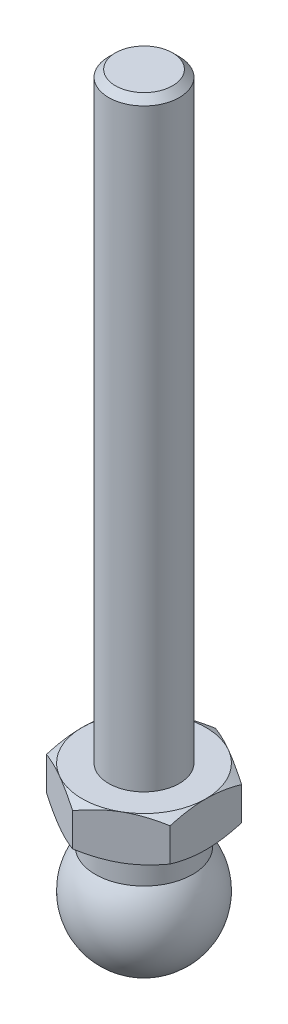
ISO-10303-21;
HEADER;
FILE_DESCRIPTION(('STEP AP214'),'2;1');
FILE_NAME('part.step','',(''),(''),'','','');
FILE_SCHEMA(('AUTOMOTIVE_DESIGN { 1 0 10303 214 1 1 1 1 }'));
ENDSEC;
DATA;
#1=APPLICATION_CONTEXT('core data for automotive mechanical design processes');
#2=APPLICATION_PROTOCOL_DEFINITION('international standard','automotive_design',2000,#1);
#3=PRODUCT_CONTEXT('',#1,'mechanical');
#4=PRODUCT('Part','Part','',(#3));
#5=PRODUCT_RELATED_PRODUCT_CATEGORY('part','',(#4));
#6=PRODUCT_DEFINITION_FORMATION('','',#4);
#7=PRODUCT_DEFINITION_CONTEXT('part definition',#1,'design');
#8=PRODUCT_DEFINITION('design','',#6,#7);
#9=PRODUCT_DEFINITION_SHAPE('','',#8);
#10=(LENGTH_UNIT() NAMED_UNIT(*) SI_UNIT(.MILLI.,.METRE.));
#11=(NAMED_UNIT(*) PLANE_ANGLE_UNIT() SI_UNIT($,.RADIAN.));
#12=(NAMED_UNIT(*) SI_UNIT($,.STERADIAN.) SOLID_ANGLE_UNIT());
#13=UNCERTAINTY_MEASURE_WITH_UNIT(LENGTH_MEASURE(1.E-05),#10,'distance_accuracy_value','');
#14=(GEOMETRIC_REPRESENTATION_CONTEXT(3) GLOBAL_UNCERTAINTY_ASSIGNED_CONTEXT((#13)) GLOBAL_UNIT_ASSIGNED_CONTEXT((#10,
#11,#12)) REPRESENTATION_CONTEXT('',''));
#15=CARTESIAN_POINT('',(0.,0.,0.));
#16=DIRECTION('',(0.,0.,1.));
#17=DIRECTION('',(1.,0.,0.));
#18=AXIS2_PLACEMENT_3D('',#15,#16,#17);
#19=CARTESIAN_POINT('',(-0.000852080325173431,7.,-0.000852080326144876));
#20=DIRECTION('',(-1.,0.,0.));
#21=DIRECTION('',(0.,0.,-1.));
#22=AXIS2_PLACEMENT_3D('',#19,#20,#21);
#23=CIRCLE('',#22,7.);
#24=TRIMMED_CURVE('',#23,(PARAMETER_VALUE(-1.57091805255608)),
(PARAMETER_VALUE(1.57091805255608)),.T.,.PARAMETER.);
#25=CARTESIAN_POINT('',(-0.000852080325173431,7.,0.));
#26=DIRECTION('',(0.,-1.,0.));
#27=AXIS1_PLACEMENT('',#25,#26);
#28=SURFACE_OF_REVOLUTION('',#24,#27);
#29=CARTESIAN_POINT('',(5.5,11.3301270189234,0.));
#30=CARTESIAN_POINT('',(5.50000190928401,11.3301270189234,0.0900075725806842));
#31=CARTESIAN_POINT('',(5.49779095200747,11.3301270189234,0.180014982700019));
#32=CARTESIAN_POINT('',(5.48895701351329,11.3301270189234,0.359813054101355));
#33=CARTESIAN_POINT('',(5.48233403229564,11.3301270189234,0.449603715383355));
#34=CARTESIAN_POINT('',(5.4646897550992,11.3301270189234,0.628751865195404));
#35=CARTESIAN_POINT('',(5.45366845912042,11.3301270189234,0.718109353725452));
#36=CARTESIAN_POINT('',(5.42725470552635,11.3301270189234,0.896175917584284));
#37=CARTESIAN_POINT('',(5.41186224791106,11.3301270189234,0.984884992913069));
#38=CARTESIAN_POINT('',(5.37674309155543,11.3301270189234,1.16144101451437));
#39=CARTESIAN_POINT('',(5.35701639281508,11.3301270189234,1.24928796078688));
#40=CARTESIAN_POINT('',(5.31327632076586,11.3301270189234,1.42390809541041));
#41=CARTESIAN_POINT('',(5.28926294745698,11.3301270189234,1.51068128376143));
#42=CARTESIAN_POINT('',(5.23700736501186,11.3301270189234,1.68294485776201));
#43=CARTESIAN_POINT('',(5.20876515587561,11.3301270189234,1.76843524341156));
#44=CARTESIAN_POINT('',(5.14811994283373,11.3301270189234,1.9379272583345));
#45=CARTESIAN_POINT('',(5.11571693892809,11.3301270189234,2.02192888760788));
#46=CARTESIAN_POINT('',(5.04682819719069,11.3301270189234,2.18824102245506));
#47=CARTESIAN_POINT('',(5.01034245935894,11.3301270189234,2.27055152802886));
#48=CARTESIAN_POINT('',(4.93337614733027,11.3301270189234,2.43328312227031));
#49=CARTESIAN_POINT('',(4.89289557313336,11.3301270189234,2.51370421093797));
#50=CARTESIAN_POINT('',(4.80803710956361,11.3301270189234,2.67246322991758));
#51=CARTESIAN_POINT('',(4.76365922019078,11.3301270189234,2.75080116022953));
#52=CARTESIAN_POINT('',(4.67111303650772,11.3301270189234,2.90520513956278));
#53=CARTESIAN_POINT('',(4.62294474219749,11.3301270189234,2.98127118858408));
#54=CARTESIAN_POINT('',(4.52293379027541,11.3301270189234,3.13094815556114));
#55=CARTESIAN_POINT('',(4.47109113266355,11.3301270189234,3.2045590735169));
#56=CARTESIAN_POINT('',(4.36385634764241,11.3301270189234,3.34914844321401));
#57=CARTESIAN_POINT('',(4.30846422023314,11.3301270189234,3.42012689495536));
#58=CARTESIAN_POINT('',(4.19426394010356,11.3301270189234,3.55928033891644));
#59=CARTESIAN_POINT('',(4.13545578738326,11.3301270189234,3.62745533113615));
#60=CARTESIAN_POINT('',(4.01456513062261,11.3301270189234,3.76083761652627));
#61=CARTESIAN_POINT('',(3.95248262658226,11.3301270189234,3.82604490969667));
#62=CARTESIAN_POINT('',(3.82519282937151,11.3301270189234,3.95333470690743));
#63=CARTESIAN_POINT('',(3.75998553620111,11.3301270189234,4.01541721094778));
#64=CARTESIAN_POINT('',(3.62660325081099,11.3301270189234,4.13630786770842));
#65=CARTESIAN_POINT('',(3.55842825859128,11.3301270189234,4.1951160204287));
#66=CARTESIAN_POINT('',(3.41927481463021,11.3301270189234,4.30931630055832));
#67=CARTESIAN_POINT('',(3.34829636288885,11.3301270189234,4.36470842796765));
#68=CARTESIAN_POINT('',(3.20370699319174,11.3301270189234,4.47194321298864));
#69=CARTESIAN_POINT('',(3.13009607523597,11.3301270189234,4.52378587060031));
#70=CARTESIAN_POINT('',(2.98041910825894,11.3301270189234,4.62379682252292));
#71=CARTESIAN_POINT('',(2.90435305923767,11.3301270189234,4.67196511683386));
#72=CARTESIAN_POINT('',(2.74994907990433,11.3301270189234,4.76451130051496));
#73=CARTESIAN_POINT('',(2.67161114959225,11.3301270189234,4.80888918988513));
#74=CARTESIAN_POINT('',(2.512852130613,11.3301270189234,4.89374765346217));
#75=CARTESIAN_POINT('',(2.43243104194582,11.3301270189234,4.93422822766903));
#76=CARTESIAN_POINT('',(2.26969944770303,11.3301270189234,5.01119453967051));
#77=CARTESIAN_POINT('',(2.18738894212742,11.3301270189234,5.04768027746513));
#78=CARTESIAN_POINT('',(2.02107680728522,11.3301270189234,5.11656901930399));
#79=CARTESIAN_POINT('',(1.93707517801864,11.3301270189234,5.14897202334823));
#80=CARTESIAN_POINT('',(1.7675831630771,11.3301270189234,5.20961723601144));
#81=CARTESIAN_POINT('',(1.68209277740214,11.3301270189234,5.23785944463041));
#82=CARTESIAN_POINT('',(1.50982920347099,11.3301270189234,5.29011502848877));
#83=CARTESIAN_POINT('',(1.42305601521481,11.3301270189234,5.31412840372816));
#84=CARTESIAN_POINT('',(1.24843588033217,11.3301270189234,5.35786847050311));
#85=CARTESIAN_POINT('',(1.16058893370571,11.3301270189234,5.37759516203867));
#86=CARTESIAN_POINT('',(0.98403291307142,11.3301270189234,5.41271433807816));
#87=CARTESIAN_POINT('',(0.89532383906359,11.3301270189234,5.42810682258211));
#88=CARTESIAN_POINT('',(0.71725727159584,11.3301270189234,5.454520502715));
#89=CARTESIAN_POINT('',(0.62789977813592,11.3301270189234,5.46554169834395));
#90=CARTESIAN_POINT('',(0.44875164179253,11.3301270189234,5.48318624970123));
#91=CARTESIAN_POINT('',(0.358960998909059,11.3301270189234,5.48980960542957));
#92=CARTESIAN_POINT('',(0.179162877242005,11.3301270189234,5.49864252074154));
#93=CARTESIAN_POINT('',(0.0891553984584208,11.3301270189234,5.50085208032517));
#94=CARTESIAN_POINT('',(-0.0908595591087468,11.3301270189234,5.50085208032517));
#95=CARTESIAN_POINT('',(-0.180867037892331,11.3301270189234,5.49864252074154));
#96=CARTESIAN_POINT('',(-0.360665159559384,11.3301270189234,5.48980960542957));
#97=CARTESIAN_POINT('',(-0.450455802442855,11.3301270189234,5.48318624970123));
#98=CARTESIAN_POINT('',(-0.629603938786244,11.3301270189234,5.46554169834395));
#99=CARTESIAN_POINT('',(-0.718961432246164,11.3301270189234,5.45452050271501));
#100=CARTESIAN_POINT('',(-0.897027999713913,11.3301270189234,5.42810682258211));
#101=CARTESIAN_POINT('',(-0.985737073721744,11.3301270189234,5.41271433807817));
#102=CARTESIAN_POINT('',(-1.16229309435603,11.3301270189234,5.37759516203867));
#103=CARTESIAN_POINT('',(-1.2501400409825,11.3301270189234,5.35786847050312));
#104=CARTESIAN_POINT('',(-1.42476017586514,11.3301270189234,5.31412840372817));
#105=CARTESIAN_POINT('',(-1.51153336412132,11.3301270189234,5.29011502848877));
#106=CARTESIAN_POINT('',(-1.68379693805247,11.3301270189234,5.23785944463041));
#107=CARTESIAN_POINT('',(-1.76928732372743,11.3301270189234,5.20961723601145));
#108=CARTESIAN_POINT('',(-1.93877933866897,11.3301270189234,5.14897202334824));
#109=CARTESIAN_POINT('',(-2.02278096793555,11.3301270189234,5.11656901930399));
#110=CARTESIAN_POINT('',(-2.18909310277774,11.3301270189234,5.04768027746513));
#111=CARTESIAN_POINT('',(-2.27140360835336,11.3301270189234,5.01119453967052));
#112=CARTESIAN_POINT('',(-2.43413520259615,11.3301270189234,4.93422822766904));
#113=CARTESIAN_POINT('',(-2.51455629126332,11.3301270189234,4.89374765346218));
#114=CARTESIAN_POINT('',(-2.67331531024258,11.3301270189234,4.80888918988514));
#115=CARTESIAN_POINT('',(-2.75165324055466,11.3301270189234,4.76451130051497));
#116=CARTESIAN_POINT('',(-2.906057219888,11.3301270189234,4.67196511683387));
#117=CARTESIAN_POINT('',(-2.98212326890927,11.3301270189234,4.62379682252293));
#118=CARTESIAN_POINT('',(-3.1318002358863,11.3301270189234,4.52378587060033));
#119=CARTESIAN_POINT('',(-3.20541115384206,11.3301270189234,4.47194321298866));
#120=CARTESIAN_POINT('',(-3.35000052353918,11.3301270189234,4.36470842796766));
#121=CARTESIAN_POINT('',(-3.42097897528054,11.3301270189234,4.30931630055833));
#122=CARTESIAN_POINT('',(-3.56013241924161,11.3301270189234,4.19511602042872));
#123=CARTESIAN_POINT('',(-3.62830741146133,11.3301270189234,4.13630786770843));
#124=CARTESIAN_POINT('',(-3.76168969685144,11.3301270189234,4.01541721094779));
#125=CARTESIAN_POINT('',(-3.82689699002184,11.3301270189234,3.95333470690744));
#126=CARTESIAN_POINT('',(-3.9541867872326,11.3301270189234,3.82604490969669));
#127=CARTESIAN_POINT('',(-4.01626929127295,11.3301270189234,3.76083761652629));
#128=CARTESIAN_POINT('',(-4.13715994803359,11.3301270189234,3.62745533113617));
#129=CARTESIAN_POINT('',(-4.19596810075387,11.3301270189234,3.55928033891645));
#130=CARTESIAN_POINT('',(-4.31016838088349,11.3301270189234,3.42012689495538));
#131=CARTESIAN_POINT('',(-4.36556050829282,11.3301270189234,3.34914844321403));
#132=CARTESIAN_POINT('',(-4.47279529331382,11.3301270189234,3.20455907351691));
#133=CARTESIAN_POINT('',(-4.52463795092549,11.3301270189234,3.13094815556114));
#134=CARTESIAN_POINT('',(-4.62464890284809,11.3301270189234,2.98127118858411));
#135=CARTESIAN_POINT('',(-4.67281719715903,11.3301270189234,2.90520513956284));
#136=CARTESIAN_POINT('',(-4.76536338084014,11.3301270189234,2.7508011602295));
#137=CARTESIAN_POINT('',(-4.80974127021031,11.3301270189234,2.67246322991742));
#138=CARTESIAN_POINT('',(-4.89459973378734,11.3301270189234,2.51370421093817));
#139=CARTESIAN_POINT('',(-4.9350803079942,11.3301270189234,2.433283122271));
#140=CARTESIAN_POINT('',(-5.01204661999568,11.3301270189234,2.27055152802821));
#141=CARTESIAN_POINT('',(-5.0485323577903,11.3301270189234,2.18824102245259));
#142=CARTESIAN_POINT('',(-5.11742109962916,11.3301270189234,2.0219288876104));
#143=CARTESIAN_POINT('',(-5.1498241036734,11.3301270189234,1.93792725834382));
#144=CARTESIAN_POINT('',(-5.21046931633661,11.3301270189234,1.76843524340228));
#145=CARTESIAN_POINT('',(-5.23871152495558,11.3301270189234,1.68294485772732));
#146=CARTESIAN_POINT('',(-5.29096710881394,11.3301270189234,1.51068128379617));
#147=CARTESIAN_POINT('',(-5.31498048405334,11.3301270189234,1.42390809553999));
#148=CARTESIAN_POINT('',(-5.35872055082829,11.3301270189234,1.24928796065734));
#149=CARTESIAN_POINT('',(-5.37844724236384,11.3301270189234,1.16144101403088));
#150=CARTESIAN_POINT('',(-5.41356641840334,11.3301270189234,0.984884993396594));
#151=CARTESIAN_POINT('',(-5.42895890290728,11.3301270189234,0.896175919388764));
#152=CARTESIAN_POINT('',(-5.45537258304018,11.3301270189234,0.718109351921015));
#153=CARTESIAN_POINT('',(-5.46639377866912,11.3301270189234,0.628751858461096));
#154=CARTESIAN_POINT('',(-5.4840383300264,11.3301270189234,0.449603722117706));
#155=CARTESIAN_POINT('',(-5.49066168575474,11.3301270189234,0.359813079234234));
#156=CARTESIAN_POINT('',(-5.49949460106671,11.3301270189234,0.180014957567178));
#157=CARTESIAN_POINT('',(-5.50170416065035,11.3301270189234,0.0900074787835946));
#158=CARTESIAN_POINT('',(-5.50170416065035,11.3301270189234,-0.090007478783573));
#159=CARTESIAN_POINT('',(-5.49949460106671,11.3301270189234,-0.180014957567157));
#160=CARTESIAN_POINT('',(-5.49066168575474,11.3301270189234,-0.359813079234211));
#161=CARTESIAN_POINT('',(-5.48403833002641,11.3301270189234,-0.449603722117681));
#162=CARTESIAN_POINT('',(-5.46639377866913,11.3301270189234,-0.62875185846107));
#163=CARTESIAN_POINT('',(-5.45537258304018,11.3301270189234,-0.718109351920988));
#164=CARTESIAN_POINT('',(-5.42895890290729,11.3301270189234,-0.896175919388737));
#165=CARTESIAN_POINT('',(-5.41356641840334,11.3301270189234,-0.984884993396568));
#166=CARTESIAN_POINT('',(-5.37844724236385,11.3301270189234,-1.16144101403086));
#167=CARTESIAN_POINT('',(-5.35872055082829,11.3301270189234,-1.24928796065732));
#168=CARTESIAN_POINT('',(-5.31498048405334,11.3301270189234,-1.42390809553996));
#169=CARTESIAN_POINT('',(-5.29096710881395,11.3301270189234,-1.51068128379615));
#170=CARTESIAN_POINT('',(-5.23871152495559,11.3301270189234,-1.68294485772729));
#171=CARTESIAN_POINT('',(-5.21046931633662,11.3301270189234,-1.76843524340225));
#172=CARTESIAN_POINT('',(-5.14982410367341,11.3301270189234,-1.93792725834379));
#173=CARTESIAN_POINT('',(-5.11742109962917,11.3301270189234,-2.02192888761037));
#174=CARTESIAN_POINT('',(-5.04853235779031,11.3301270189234,-2.18824102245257));
#175=CARTESIAN_POINT('',(-5.01204661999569,11.3301270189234,-2.27055152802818));
#176=CARTESIAN_POINT('',(-4.93508030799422,11.3301270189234,-2.43328312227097));
#177=CARTESIAN_POINT('',(-4.89459973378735,11.3301270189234,-2.51370421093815));
#178=CARTESIAN_POINT('',(-4.80974127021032,11.3301270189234,-2.6724632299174));
#179=CARTESIAN_POINT('',(-4.76536338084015,11.3301270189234,-2.75080116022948));
#180=CARTESIAN_POINT('',(-4.67281719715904,11.3301270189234,-2.90520513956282));
#181=CARTESIAN_POINT('',(-4.6246489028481,11.3301270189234,-2.98127118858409));
#182=CARTESIAN_POINT('',(-4.5246379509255,11.3301270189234,-3.13094815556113));
#183=CARTESIAN_POINT('',(-4.47279529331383,11.3301270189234,-3.20455907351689));
#184=CARTESIAN_POINT('',(-4.36556050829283,11.3301270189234,-3.34914844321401));
#185=CARTESIAN_POINT('',(-4.31016838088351,11.3301270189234,-3.42012689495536));
#186=CARTESIAN_POINT('',(-4.19596810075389,11.3301270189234,-3.55928033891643));
#187=CARTESIAN_POINT('',(-4.13715994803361,11.3301270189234,-3.62745533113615));
#188=CARTESIAN_POINT('',(-4.01626929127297,11.3301270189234,-3.76083761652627));
#189=CARTESIAN_POINT('',(-3.95418678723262,11.3301270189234,-3.82604490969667));
#190=CARTESIAN_POINT('',(-3.82689699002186,11.3301270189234,-3.95333470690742));
#191=CARTESIAN_POINT('',(-3.76168969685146,11.3301270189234,-4.01541721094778));
#192=CARTESIAN_POINT('',(-3.62830741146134,11.3301270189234,-4.13630786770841));
#193=CARTESIAN_POINT('',(-3.56013241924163,11.3301270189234,-4.1951160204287));
#194=CARTESIAN_POINT('',(-3.42097897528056,11.3301270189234,-4.30931630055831));
#195=CARTESIAN_POINT('',(-3.3500005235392,11.3301270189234,-4.36470842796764));
#196=CARTESIAN_POINT('',(-3.20541115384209,11.3301270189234,-4.47194321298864));
#197=CARTESIAN_POINT('',(-3.13180023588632,11.3301270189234,-4.52378587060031));
#198=CARTESIAN_POINT('',(-2.98212326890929,11.3301270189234,-4.62379682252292));
#199=CARTESIAN_POINT('',(-2.90605721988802,11.3301270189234,-4.67196511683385));
#200=CARTESIAN_POINT('',(-2.75165324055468,11.3301270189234,-4.76451130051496));
#201=CARTESIAN_POINT('',(-2.6733153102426,11.3301270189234,-4.80888918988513));
#202=CARTESIAN_POINT('',(-2.51455629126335,11.3301270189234,-4.89374765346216));
#203=CARTESIAN_POINT('',(-2.43413520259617,11.3301270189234,-4.93422822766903));
#204=CARTESIAN_POINT('',(-2.27140360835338,11.3301270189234,-5.01119453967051));
#205=CARTESIAN_POINT('',(-2.18909310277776,11.3301270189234,-5.04768027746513));
#206=CARTESIAN_POINT('',(-2.02278096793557,11.3301270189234,-5.11656901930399));
#207=CARTESIAN_POINT('',(-1.93877933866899,11.3301270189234,-5.14897202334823));
#208=CARTESIAN_POINT('',(-1.76928732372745,11.3301270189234,-5.20961723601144));
#209=CARTESIAN_POINT('',(-1.68379693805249,11.3301270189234,-5.2378594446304));
#210=CARTESIAN_POINT('',(-1.51153336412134,11.3301270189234,-5.29011502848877));
#211=CARTESIAN_POINT('',(-1.42476017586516,11.3301270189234,-5.31412840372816));
#212=CARTESIAN_POINT('',(-1.25014004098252,11.3301270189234,-5.35786847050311));
#213=CARTESIAN_POINT('',(-1.16229309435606,11.3301270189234,-5.37759516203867));
#214=CARTESIAN_POINT('',(-0.985737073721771,11.3301270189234,-5.41271433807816));
#215=CARTESIAN_POINT('',(-0.897027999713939,11.3301270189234,-5.42810682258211));
#216=CARTESIAN_POINT('',(-0.718961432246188,11.3301270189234,-5.454520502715));
#217=CARTESIAN_POINT('',(-0.62960393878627,11.3301270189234,-5.46554169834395));
#218=CARTESIAN_POINT('',(-0.450455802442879,11.3301270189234,-5.48318624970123));
#219=CARTESIAN_POINT('',(-0.360665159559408,11.3301270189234,-5.48980960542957));
#220=CARTESIAN_POINT('',(-0.180867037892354,11.3301270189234,-5.49864252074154));
#221=CARTESIAN_POINT('',(-0.0908595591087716,11.3301270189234,-5.50085208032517));
#222=CARTESIAN_POINT('',(0.089155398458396,11.3301270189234,-5.50085208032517));
#223=CARTESIAN_POINT('',(0.179162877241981,11.3301270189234,-5.49864252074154));
#224=CARTESIAN_POINT('',(0.358960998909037,11.3301270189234,-5.48980960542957));
#225=CARTESIAN_POINT('',(0.448751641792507,11.3301270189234,-5.48318624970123));
#226=CARTESIAN_POINT('',(0.627899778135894,11.3301270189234,-5.46554169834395));
#227=CARTESIAN_POINT('',(0.717257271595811,11.3301270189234,-5.45452050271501));
#228=CARTESIAN_POINT('',(0.89532383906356,11.3301270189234,-5.42810682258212));
#229=CARTESIAN_POINT('',(0.984032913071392,11.3301270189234,-5.41271433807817));
#230=CARTESIAN_POINT('',(1.16058893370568,11.3301270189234,-5.37759516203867));
#231=CARTESIAN_POINT('',(1.24843588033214,11.3301270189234,-5.35786847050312));
#232=CARTESIAN_POINT('',(1.42305601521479,11.3301270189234,-5.31412840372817));
#233=CARTESIAN_POINT('',(1.50982920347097,11.3301270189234,-5.29011502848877));
#234=CARTESIAN_POINT('',(1.68209277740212,11.3301270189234,-5.23785944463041));
#235=CARTESIAN_POINT('',(1.76758316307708,11.3301270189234,-5.20961723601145));
#236=CARTESIAN_POINT('',(1.93707517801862,11.3301270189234,-5.14897202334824));
#237=CARTESIAN_POINT('',(2.0210768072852,11.3301270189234,-5.116569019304));
#238=CARTESIAN_POINT('',(2.18738894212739,11.3301270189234,-5.04768027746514));
#239=CARTESIAN_POINT('',(2.26969944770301,11.3301270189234,-5.01119453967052));
#240=CARTESIAN_POINT('',(2.4324310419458,11.3301270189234,-4.93422822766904));
#241=CARTESIAN_POINT('',(2.51285213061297,11.3301270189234,-4.89374765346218));
#242=CARTESIAN_POINT('',(2.67161114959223,11.3301270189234,-4.80888918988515));
#243=CARTESIAN_POINT('',(2.7499490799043,11.3301270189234,-4.76451130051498));
#244=CARTESIAN_POINT('',(2.90435305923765,11.3301270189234,-4.67196511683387));
#245=CARTESIAN_POINT('',(2.98041910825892,11.3301270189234,-4.62379682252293));
#246=CARTESIAN_POINT('',(3.13009607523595,11.3301270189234,-4.52378587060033));
#247=CARTESIAN_POINT('',(3.20370699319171,11.3301270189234,-4.47194321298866));
#248=CARTESIAN_POINT('',(3.34829636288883,11.3301270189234,-4.36470842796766));
#249=CARTESIAN_POINT('',(3.41927481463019,11.3301270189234,-4.30931630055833));
#250=CARTESIAN_POINT('',(3.55842825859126,11.3301270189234,-4.19511602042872));
#251=CARTESIAN_POINT('',(3.62660325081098,11.3301270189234,-4.13630786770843));
#252=CARTESIAN_POINT('',(3.7599855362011,11.3301270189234,-4.0154172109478));
#253=CARTESIAN_POINT('',(3.8251928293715,11.3301270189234,-3.95333470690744));
#254=CARTESIAN_POINT('',(3.95248262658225,11.3301270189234,-3.82604490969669));
#255=CARTESIAN_POINT('',(4.0145651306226,11.3301270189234,-3.76083761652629));
#256=CARTESIAN_POINT('',(4.13545578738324,11.3301270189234,-3.62745533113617));
#257=CARTESIAN_POINT('',(4.19426394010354,11.3301270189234,-3.55928033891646));
#258=CARTESIAN_POINT('',(4.30846422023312,11.3301270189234,-3.42012689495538));
#259=CARTESIAN_POINT('',(4.3638563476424,11.3301270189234,-3.34914844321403));
#260=CARTESIAN_POINT('',(4.47109113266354,11.3301270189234,-3.20455907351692));
#261=CARTESIAN_POINT('',(4.5229337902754,11.3301270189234,-3.13094815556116));
#262=CARTESIAN_POINT('',(4.62294474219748,11.3301270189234,-2.98127118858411));
#263=CARTESIAN_POINT('',(4.6711130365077,11.3301270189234,-2.9052051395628));
#264=CARTESIAN_POINT('',(4.76365922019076,11.3301270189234,-2.75080116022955));
#265=CARTESIAN_POINT('',(4.8080371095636,11.3301270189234,-2.67246322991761));
#266=CARTESIAN_POINT('',(4.89289557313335,11.3301270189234,-2.513704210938));
#267=CARTESIAN_POINT('',(4.93337614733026,11.3301270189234,-2.43328312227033));
#268=CARTESIAN_POINT('',(5.01034245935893,11.3301270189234,-2.27055152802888));
#269=CARTESIAN_POINT('',(5.04682819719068,11.3301270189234,-2.18824102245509));
#270=CARTESIAN_POINT('',(5.11571693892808,11.3301270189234,-2.02192888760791));
#271=CARTESIAN_POINT('',(5.14811994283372,11.3301270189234,-1.93792725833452));
#272=CARTESIAN_POINT('',(5.2087651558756,11.3301270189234,-1.76843524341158));
#273=CARTESIAN_POINT('',(5.23700736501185,11.3301270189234,-1.68294485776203));
#274=CARTESIAN_POINT('',(5.28926294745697,11.3301270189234,-1.51068128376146));
#275=CARTESIAN_POINT('',(5.31327632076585,11.3301270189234,-1.42390809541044));
#276=CARTESIAN_POINT('',(5.35701639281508,11.3301270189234,-1.2492879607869));
#277=CARTESIAN_POINT('',(5.37674309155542,11.3301270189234,-1.16144101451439));
#278=CARTESIAN_POINT('',(5.41186224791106,11.3301270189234,-0.984884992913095));
#279=CARTESIAN_POINT('',(5.42725470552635,11.3301270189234,-0.896175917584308));
#280=CARTESIAN_POINT('',(5.45366845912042,11.3301270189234,-0.718109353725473));
#281=CARTESIAN_POINT('',(5.4646897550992,11.3301270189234,-0.628751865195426));
#282=CARTESIAN_POINT('',(5.48233403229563,11.3301270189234,-0.449603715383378));
#283=CARTESIAN_POINT('',(5.48895701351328,11.3301270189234,-0.359813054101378));
#284=CARTESIAN_POINT('',(5.49779095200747,11.3301270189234,-0.180014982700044));
#285=CARTESIAN_POINT('',(5.50000190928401,11.3301270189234,-0.0900075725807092));
#286=CARTESIAN_POINT('',(5.5,11.3301270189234,0.));
#287=B_SPLINE_CURVE_WITH_KNOTS('',3,(#29,#30,#31,#32,#33,#34,#35,#36,#37,#38,#39,#40,#41,#42,
#43,#44,#45,#46,#47,#48,#49,#50,#51,#52,#53,#54,#55,#56,#57,#58,#59,#60,#61,#62,#63,#64,#65,#66,
#67,#68,#69,#70,#71,#72,#73,#74,#75,#76,#77,#78,#79,#80,#81,#82,#83,#84,#85,#86,#87,#88,#89,#90,
#91,#92,#93,#94,#95,#96,#97,#98,#99,#100,#101,#102,#103,#104,#105,#106,#107,#108,#109,#110,#111,
#112,#113,#114,#115,#116,#117,#118,#119,#120,#121,#122,#123,#124,#125,#126,#127,#128,#129,#130,
#131,#132,#133,#134,#135,#136,#137,#138,#139,#140,#141,#142,#143,#144,#145,#146,#147,#148,#149,
#150,#151,#152,#153,#154,#155,#156,#157,#158,#159,#160,#161,#162,#163,#164,#165,#166,#167,#168,
#169,#170,#171,#172,#173,#174,#175,#176,#177,#178,#179,#180,#181,#182,#183,#184,#185,#186,#187,
#188,#189,#190,#191,#192,#193,#194,#195,#196,#197,#198,#199,#200,#201,#202,#203,#204,#205,#206,
#207,#208,#209,#210,#211,#212,#213,#214,#215,#216,#217,#218,#219,#220,#221,#222,#223,#224,#225,
#226,#227,#228,#229,#230,#231,#232,#233,#234,#235,#236,#237,#238,#239,#240,#241,#242,#243,#244,
#245,#246,#247,#248,#249,#250,#251,#252,#253,#254,#255,#256,#257,#258,#259,#260,#261,#262,#263,
#264,#265,#266,#267,#268,#269,#270,#271,#272,#273,#274,#275,#276,#277,#278,#279,#280,#281,#282,
#283,#284,#285,#286),.UNSPECIFIED.,.F.,.F.,(4,2,2,2,2,2,2,2,2,2,2,2,2,2,2,2,2,2,2,2,2,2,2,2,2,2,
2,2,2,2,2,2,2,2,2,2,2,2,2,2,2,2,2,2,2,2,2,2,2,2,2,2,2,2,2,2,2,2,2,2,2,2,2,2,2,2,2,2,2,2,2,2,2,2,
2,2,2,2,2,2,2,2,2,2,2,2,2,2,2,2,2,2,2,2,2,2,2,2,2,2,2,2,2,2,2,2,2,2,2,2,2,2,2,2,2,2,2,2,2,2,2,2,
2,2,2,2,2,2,4),(0.,0.269995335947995,0.539990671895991,0.809986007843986,1.07998134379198,
1.34997667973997,1.61997201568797,1.88996735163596,2.15996268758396,2.42995802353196,
2.69995335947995,2.96994869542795,3.23994403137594,3.50993936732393,3.77993470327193,
4.04993003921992,4.31992537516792,4.58992071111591,4.85991604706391,5.1299113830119,
5.3999067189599,5.66990205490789,5.93989739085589,6.20989272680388,6.47988806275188,
6.74988339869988,7.01987873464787,7.28987407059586,7.55986940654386,7.82986474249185,
8.09986007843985,8.36985541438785,8.63985075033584,8.90984608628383,9.17984142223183,
9.44983675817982,9.71983209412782,9.98982743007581,10.2598227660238,10.5298181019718,
10.7998134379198,11.0698087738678,11.3398041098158,11.6097994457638,11.8797947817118,
12.1497901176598,12.4197854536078,12.6897807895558,12.9597761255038,13.2297714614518,
13.4997667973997,13.7697621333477,14.0397574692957,14.3097528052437,14.5797481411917,
14.8497434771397,15.1197388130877,15.3897341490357,15.6597294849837,15.9297248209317,
16.1997201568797,16.4697154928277,16.7397108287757,17.0097061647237,17.2797015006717,
17.5496968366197,17.8196921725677,18.0896875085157,18.3596828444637,18.6296781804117,
18.8996735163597,19.1696688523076,19.4396641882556,19.7096595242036,19.9796548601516,
20.2496501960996,20.5196455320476,20.7896408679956,21.0596362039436,21.3296315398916,
21.5996268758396,21.8696222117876,22.1396175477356,22.4096128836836,22.6796082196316,
22.9496035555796,23.2195988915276,23.4895942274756,23.7595895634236,24.0295848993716,
24.2995802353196,24.5695755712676,24.8395709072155,25.1095662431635,25.3795615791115,
25.6495569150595,25.9195522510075,26.1895475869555,26.4595429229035,26.7295382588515,
26.9995335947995,27.2695289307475,27.5395242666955,27.8095196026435,28.0795149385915,
28.3495102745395,28.6195056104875,28.8895009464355,29.1594962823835,29.4294916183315,
29.6994869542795,29.9694822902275,30.2394776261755,30.5094729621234,30.7794682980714,
31.0494636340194,31.3194589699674,31.5894543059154,31.8594496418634,32.1294449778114,
32.3994403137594,32.6694356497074,32.9394309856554,33.2094263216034,33.4794216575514,
33.7494169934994,34.0194123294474,34.2894076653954,34.5594030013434),.UNSPECIFIED.);
#288=CARTESIAN_POINT('',(5.5,11.3301270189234,0.));
#289=VERTEX_POINT('',#288);
#290=EDGE_CURVE('E11',#289,#289,#287,.T.);
#291=ORIENTED_EDGE('',*,*,#290,.T.);
#292=EDGE_LOOP('',(#291));
#293=FACE_BOUND('',#292,.T.);
#294=CARTESIAN_POINT('',(-0.000852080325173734,5.18600622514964E-08,0.));
#295=VERTEX_POINT('',#294);
#296=VERTEX_LOOP('',#295);
#297=FACE_BOUND('',#296,.T.);
#298=ADVANCED_FACE('F17',(#293,#297),#28,.T.);
#299=CARTESIAN_POINT('',(0.,0.,0.));
#300=DIRECTION('',(0.,-1.,0.));
#301=DIRECTION('',(0.,0.,-1.));
#302=AXIS2_PLACEMENT_3D('',#299,#300,#301);
#303=CYLINDRICAL_SURFACE('',#302,5.5);
#304=ORIENTED_EDGE('',*,*,#290,.F.);
#305=EDGE_LOOP('',(#304));
#306=FACE_BOUND('',#305,.T.);
#307=CARTESIAN_POINT('',(0.,14.5,0.));
#308=DIRECTION('',(0.,-1.,0.));
#309=DIRECTION('',(0.,0.,-1.));
#310=AXIS2_PLACEMENT_3D('',#307,#308,#309);
#311=CIRCLE('',#310,5.5);
#312=CARTESIAN_POINT('',(0.,14.5,-5.5));
#313=VERTEX_POINT('',#312);
#314=EDGE_CURVE('E150',#313,#313,#311,.T.);
#315=ORIENTED_EDGE('',*,*,#314,.T.);
#316=EDGE_LOOP('',(#315));
#317=FACE_BOUND('',#316,.T.);
#318=ADVANCED_FACE('F256',(#306,#317),#303,.T.);
#319=CARTESIAN_POINT('',(7.,14.5,0.));
#320=DIRECTION('',(0.,1.,0.));
#321=DIRECTION('',(0.,0.,1.));
#322=AXIS2_PLACEMENT_3D('',#319,#320,#321);
#323=PLANE('',#322);
#324=ORIENTED_EDGE('',*,*,#314,.F.);
#325=EDGE_LOOP('',(#324));
#326=FACE_BOUND('',#325,.T.);
#327=CARTESIAN_POINT('',(0.,14.5,0.));
#328=DIRECTION('',(0.,-1.,0.));
#329=DIRECTION('',(0.,0.,-1.));
#330=AXIS2_PLACEMENT_3D('',#327,#328,#329);
#331=CIRCLE('',#330,7.);
#332=CARTESIAN_POINT('',(3.5,14.5,-6.06217782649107));
#333=VERTEX_POINT('',#332);
#334=CARTESIAN_POINT('',(7.,14.5,0.));
#335=VERTEX_POINT('',#334);
#336=EDGE_CURVE('E149',#333,#335,#331,.T.);
#337=ORIENTED_EDGE('',*,*,#336,.T.);
#338=CARTESIAN_POINT('',(3.5,14.5,6.06217782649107));
#339=VERTEX_POINT('',#338);
#340=EDGE_CURVE('E145',#335,#339,#331,.T.);
#341=ORIENTED_EDGE('',*,*,#340,.T.);
#342=CARTESIAN_POINT('',(-3.5,14.5,6.06217782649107));
#343=VERTEX_POINT('',#342);
#344=EDGE_CURVE('E148',#339,#343,#331,.T.);
#345=ORIENTED_EDGE('',*,*,#344,.T.);
#346=CARTESIAN_POINT('',(-7.,14.5,0.));
#347=VERTEX_POINT('',#346);
#348=EDGE_CURVE('E216',#343,#347,#331,.T.);
#349=ORIENTED_EDGE('',*,*,#348,.T.);
#350=CARTESIAN_POINT('',(-3.5,14.5,-6.06217782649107));
#351=VERTEX_POINT('',#350);
#352=EDGE_CURVE('E219',#347,#351,#331,.T.);
#353=ORIENTED_EDGE('',*,*,#352,.T.);
#354=EDGE_CURVE('E224',#351,#333,#331,.T.);
#355=ORIENTED_EDGE('',*,*,#354,.T.);
#356=EDGE_LOOP('',(#337,#341,#345,#349,#353,#355));
#357=FACE_BOUND('',#356,.T.);
#358=ADVANCED_FACE('F226',(#326,#357),#323,.F.);
#359=CARTESIAN_POINT('',(0.,17.,0.));
#360=DIRECTION('',(0.,1.,0.));
#361=DIRECTION('',(0.,0.,1.));
#362=AXIS2_PLACEMENT_3D('',#359,#360,#361);
#363=CONICAL_SURFACE('',#362,11.3301270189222,1.0471975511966);
#364=CARTESIAN_POINT('',(-7.,18.7311663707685,-12.5023453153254));
#365=CARTESIAN_POINT('',(-7.,18.5815303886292,-12.2052647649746));
#366=CARTESIAN_POINT('',(-7.,18.4328732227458,-11.9076861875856));
#367=CARTESIAN_POINT('',(-7.,18.1379923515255,-11.3113035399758));
#368=CARTESIAN_POINT('',(-7.,17.9917687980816,-11.0124993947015));
#369=CARTESIAN_POINT('',(-7.,17.7019718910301,-10.4128982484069));
#370=CARTESIAN_POINT('',(-7.,17.558404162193,-10.1120985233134));
#371=CARTESIAN_POINT('',(-7.,17.2748703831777,-9.50881013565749));
#372=CARTESIAN_POINT('',(-7.,17.1349042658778,-9.20632150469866));
#373=CARTESIAN_POINT('',(-7.,16.8529572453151,-8.58510325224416));
#374=CARTESIAN_POINT('',(-7.,16.7111891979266,-8.26627671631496));
#375=CARTESIAN_POINT('',(-7.,16.4337799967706,-7.62594250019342));
#376=CARTESIAN_POINT('',(-7.,16.2981391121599,-7.30443470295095));
#377=CARTESIAN_POINT('',(-7.,16.0347503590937,-6.65840905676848));
#378=CARTESIAN_POINT('',(-7.,15.9069977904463,-6.33389313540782));
#379=CARTESIAN_POINT('',(-7.,15.6615459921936,-5.68109770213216));
#380=CARTESIAN_POINT('',(-7.,15.5438456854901,-5.35281859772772));
#381=CARTESIAN_POINT('',(-7.,15.2971834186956,-4.6199854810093));
#382=CARTESIAN_POINT('',(-7.,15.1713376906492,-4.21436746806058));
#383=CARTESIAN_POINT('',(-7.,14.9456475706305,-3.39574912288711));
#384=CARTESIAN_POINT('',(-7.,14.8458019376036,-2.98274914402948));
#385=CARTESIAN_POINT('',(-7.,14.7223937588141,-2.3617886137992));
#386=CARTESIAN_POINT('',(-7.,14.6858621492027,-2.1563862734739));
#387=CARTESIAN_POINT('',(-7.,14.6219895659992,-1.74416917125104));
#388=CARTESIAN_POINT('',(-7.,14.5946472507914,-1.53735462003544));
#389=CARTESIAN_POINT('',(-7.,14.5499624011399,-1.12270765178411));
#390=CARTESIAN_POINT('',(-7.,14.532616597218,-0.914875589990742));
#391=CARTESIAN_POINT('',(-7.,14.5084749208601,-0.498594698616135));
#392=CARTESIAN_POINT('',(-7.,14.5016789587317,-0.290145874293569));
#393=CARTESIAN_POINT('',(-7.,14.4988602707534,0.128421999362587));
#394=CARTESIAN_POINT('',(-7.,14.5029204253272,0.338541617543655));
#395=CARTESIAN_POINT('',(-7.,14.5218478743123,0.758289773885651));
#396=CARTESIAN_POINT('',(-7.,14.5367152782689,0.967918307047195));
#397=CARTESIAN_POINT('',(-7.,14.5767654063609,1.38625975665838));
#398=CARTESIAN_POINT('',(-7.,14.6019520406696,1.59497229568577));
#399=CARTESIAN_POINT('',(-7.,14.6618619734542,2.01100790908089));
#400=CARTESIAN_POINT('',(-7.,14.6965854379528,2.21833095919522));
#401=CARTESIAN_POINT('',(-7.,14.8150591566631,2.84522045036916));
#402=CARTESIAN_POINT('',(-7.,14.9123430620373,3.26225118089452));
#403=CARTESIAN_POINT('',(-7.,15.1341531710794,4.08879182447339));
#404=CARTESIAN_POINT('',(-7.,15.2586819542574,4.4983010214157));
#405=CARTESIAN_POINT('',(-7.,15.5046153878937,5.2406101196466));
#406=CARTESIAN_POINT('',(-7.,15.6228627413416,5.5744719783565));
#407=CARTESIAN_POINT('',(-7.,15.8699990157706,6.23825206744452));
#408=CARTESIAN_POINT('',(-7.,15.9988892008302,6.56816982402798));
#409=CARTESIAN_POINT('',(-7.,16.2649802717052,7.22486424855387));
#410=CARTESIAN_POINT('',(-7.,16.4021864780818,7.55163874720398));
#411=CARTESIAN_POINT('',(-7.,16.6830268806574,8.20238370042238));
#412=CARTESIAN_POINT('',(-7.,16.8266607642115,8.5263542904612));
#413=CARTESIAN_POINT('',(-7.,17.1123554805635,9.15729037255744));
#414=CARTESIAN_POINT('',(-7.,17.2541902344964,9.46435857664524));
#415=CARTESIAN_POINT('',(-7.,17.5416023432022,10.0767426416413));
#416=CARTESIAN_POINT('',(-7.,17.6871797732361,10.38205846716));
#417=CARTESIAN_POINT('',(-7.,17.981073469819,10.990585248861));
#418=CARTESIAN_POINT('',(-7.,18.1293834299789,11.2937992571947));
#419=CARTESIAN_POINT('',(-7.,18.4285156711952,11.8989613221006));
#420=CARTESIAN_POINT('',(-7.,18.5793377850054,12.2009094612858));
#421=CARTESIAN_POINT('',(-7.,18.7311663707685,12.5023453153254));
#422=B_SPLINE_CURVE_WITH_KNOTS('',3,(#364,#365,#366,#367,#368,#369,#370,#371,#372,#373,#374,
#375,#376,#377,#378,#379,#380,#381,#382,#383,#384,#385,#386,#387,#388,#389,#390,#391,#392,#393,
#394,#395,#396,#397,#398,#399,#400,#401,#402,#403,#404,#405,#406,#407,#408,#409,#410,#411,#412,
#413,#414,#415,#416,#417,#418,#419,#420,#421),.UNSPECIFIED.,.F.,.F.,(4,2,2,2,2,2,2,2,2,2,2,2,2,
2,2,2,2,2,2,2,2,2,2,2,2,2,2,2,4),(0.,0.997917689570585,1.99589743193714,2.99579247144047,
3.99566886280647,5.04239250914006,6.08916209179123,7.13530182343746,8.18132932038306,
9.45480706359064,10.7282240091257,11.3539282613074,11.9795411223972,12.6049492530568,
13.2303520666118,13.8605430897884,14.490740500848,15.1211769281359,15.7516243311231,
17.0349275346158,18.3183522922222,19.380686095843,20.4431462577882,21.506293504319,
22.5693890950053,23.5840866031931,24.5988045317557,25.6114179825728,26.6239642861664),.UNSPECIFIED.);
#423=CARTESIAN_POINT('',(-7.,15.1252147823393,4.04145188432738));
#424=VERTEX_POINT('',#423);
#425=EDGE_CURVE('E161',#347,#424,#422,.T.);
#426=ORIENTED_EDGE('',*,*,#425,.F.);
#427=ORIENTED_EDGE('',*,*,#348,.F.);
#428=CARTESIAN_POINT('',(-7.0002,15.1252814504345,4.04133641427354));
#429=CARTESIAN_POINT('',(-6.84633209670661,15.0739998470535,4.13017208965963));
#430=CARTESIAN_POINT('',(-6.69189049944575,15.0250455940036,4.21933898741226));
#431=CARTESIAN_POINT('',(-6.38175307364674,14.9324327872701,4.39839691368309));
#432=CARTESIAN_POINT('',(-6.22605673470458,14.8887765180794,4.48828823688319));
#433=CARTESIAN_POINT('',(-5.75647483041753,14.7666115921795,4.75940147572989));
#434=CARTESIAN_POINT('',(-5.4407356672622,14.697125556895,4.94169356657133));
#435=CARTESIAN_POINT('',(-4.96823775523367,14.6156449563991,5.21449036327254));
#436=CARTESIAN_POINT('',(-4.81289077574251,14.5924334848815,5.30417998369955));
#437=CARTESIAN_POINT('',(-4.50149488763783,14.5535112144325,5.48396448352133));
#438=CARTESIAN_POINT('',(-4.34544604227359,14.5377997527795,5.57405932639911));
#439=CARTESIAN_POINT('',(-4.03307732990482,14.5142779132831,5.75440548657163));
#440=CARTESIAN_POINT('',(-3.87675797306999,14.5064585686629,5.84465650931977));
#441=CARTESIAN_POINT('',(-3.56398349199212,14.4988802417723,6.02523694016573));
#442=CARTESIAN_POINT('',(-3.40752837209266,14.499121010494,6.11556634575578));
#443=CARTESIAN_POINT('',(-2.97889312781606,14.5108597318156,6.36303901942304));
#444=CARTESIAN_POINT('',(-2.7068533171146,14.5305657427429,6.52010127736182));
#445=CARTESIAN_POINT('',(-2.1645805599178,14.5930534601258,6.83318259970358));
#446=CARTESIAN_POINT('',(-1.89434952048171,14.635856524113,6.9892005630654));
#447=CARTESIAN_POINT('',(-1.35098545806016,14.7428516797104,7.30291195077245));
#448=CARTESIAN_POINT('',(-1.07792099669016,14.8074970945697,7.46056579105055));
#449=CARTESIAN_POINT('',(-0.53586421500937,14.954216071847,7.77352241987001));
#450=CARTESIAN_POINT('',(-0.266864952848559,15.0362551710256,7.92882921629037));
#451=CARTESIAN_POINT('',(0.000199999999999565,15.1252814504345,8.0830192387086));
#452=B_SPLINE_CURVE_WITH_KNOTS('',3,(#428,#429,#430,#431,#432,#433,#434,#435,#436,#437,#438,
#439,#440,#441,#442,#443,#444,#445,#446,#447,#448,#449,#450,#451),.UNSPECIFIED.,.F.,.F.,(4,2,2,
2,2,2,2,2,2,2,2,4),(0.,0.554727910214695,1.10969417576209,2.2219327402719,2.76443041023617,
3.30688013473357,3.8487128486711,4.39052882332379,5.33376515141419,6.27787517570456,
7.2429241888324,8.20607866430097),.UNSPECIFIED.);
#453=EDGE_CURVE('E124',#424,#343,#452,.T.);
#454=ORIENTED_EDGE('',*,*,#453,.F.);
#455=EDGE_LOOP('',(#426,#427,#454));
#456=FACE_BOUND('',#455,.T.);
#457=ADVANCED_FACE('F214',(#456),#363,.T.);
#458=CARTESIAN_POINT('',(0.000200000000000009,15.1252814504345,-8.0830192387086));
#459=CARTESIAN_POINT('',(-0.153667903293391,15.0739998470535,-7.99418356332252));
#460=CARTESIAN_POINT('',(-0.30810950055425,15.0250455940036,-7.90501666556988));
#461=CARTESIAN_POINT('',(-0.618246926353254,14.9324327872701,-7.72595873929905));
#462=CARTESIAN_POINT('',(-0.773943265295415,14.8887765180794,-7.63606741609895));
#463=CARTESIAN_POINT('',(-1.24352516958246,14.7666115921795,-7.36495417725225));
#464=CARTESIAN_POINT('',(-1.5592643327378,14.697125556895,-7.18266208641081));
#465=CARTESIAN_POINT('',(-2.03176224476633,14.6156449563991,-6.9098652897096));
#466=CARTESIAN_POINT('',(-2.18710922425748,14.5924334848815,-6.82017566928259));
#467=CARTESIAN_POINT('',(-2.49850511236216,14.5535112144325,-6.64039116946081));
#468=CARTESIAN_POINT('',(-2.65455395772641,14.5377997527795,-6.55029632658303));
#469=CARTESIAN_POINT('',(-2.96692267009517,14.5142779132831,-6.36995016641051));
#470=CARTESIAN_POINT('',(-3.12324202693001,14.5064585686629,-6.27969914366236));
#471=CARTESIAN_POINT('',(-3.43601650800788,14.4988802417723,-6.09911871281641));
#472=CARTESIAN_POINT('',(-3.59247162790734,14.499121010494,-6.00878930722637));
#473=CARTESIAN_POINT('',(-4.02110687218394,14.5108597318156,-5.76131663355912));
#474=CARTESIAN_POINT('',(-4.2931466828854,14.5305657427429,-5.60425437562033));
#475=CARTESIAN_POINT('',(-4.8354194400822,14.5930534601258,-5.29117305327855));
#476=CARTESIAN_POINT('',(-5.10565047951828,14.635856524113,-5.13515508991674));
#477=CARTESIAN_POINT('',(-5.64901454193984,14.7428516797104,-4.82144370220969));
#478=CARTESIAN_POINT('',(-5.92207900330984,14.8074970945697,-4.66378986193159));
#479=CARTESIAN_POINT('',(-6.46413578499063,14.954216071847,-4.35083323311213));
#480=CARTESIAN_POINT('',(-6.73313504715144,15.0362551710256,-4.19552643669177));
#481=CARTESIAN_POINT('',(-7.0002,15.1252814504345,-4.04133641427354));
#482=B_SPLINE_CURVE_WITH_KNOTS('',3,(#458,#459,#460,#461,#462,#463,#464,#465,#466,#467,#468,
#469,#470,#471,#472,#473,#474,#475,#476,#477,#478,#479,#480,#481),.UNSPECIFIED.,.F.,.F.,(4,2,2,
2,2,2,2,2,2,2,2,4),(0.,0.554727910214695,1.10969417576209,2.2219327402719,2.76443041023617,
3.30688013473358,3.8487128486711,4.39052882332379,5.33376515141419,6.27787517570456,
7.2429241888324,8.20607866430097),.UNSPECIFIED.);
#483=CARTESIAN_POINT('',(-7.,15.1252147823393,-4.04145188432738));
#484=VERTEX_POINT('',#483);
#485=EDGE_CURVE('E186',#351,#484,#482,.T.);
#486=ORIENTED_EDGE('',*,*,#485,.F.);
#487=ORIENTED_EDGE('',*,*,#352,.F.);
#488=EDGE_CURVE('E160',#484,#347,#422,.T.);
#489=ORIENTED_EDGE('',*,*,#488,.F.);
#490=EDGE_LOOP('',(#486,#487,#489));
#491=FACE_BOUND('',#490,.T.);
#492=ADVANCED_FACE('F220',(#491),#363,.T.);
#493=CARTESIAN_POINT('',(7.0002,15.1252814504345,-4.04133641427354));
#494=CARTESIAN_POINT('',(6.84633209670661,15.0739998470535,-4.13017208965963));
#495=CARTESIAN_POINT('',(6.69189049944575,15.0250455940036,-4.21933898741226));
#496=CARTESIAN_POINT('',(6.38175307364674,14.9324327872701,-4.39839691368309));
#497=CARTESIAN_POINT('',(6.22605673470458,14.8887765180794,-4.48828823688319));
#498=CARTESIAN_POINT('',(5.75647483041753,14.7666115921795,-4.75940147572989));
#499=CARTESIAN_POINT('',(5.4407356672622,14.697125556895,-4.94169356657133));
#500=CARTESIAN_POINT('',(4.96823775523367,14.6156449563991,-5.21449036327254));
#501=CARTESIAN_POINT('',(4.81289077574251,14.5924334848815,-5.30417998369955));
#502=CARTESIAN_POINT('',(4.50149488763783,14.5535112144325,-5.48396448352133));
#503=CARTESIAN_POINT('',(4.34544604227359,14.5377997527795,-5.57405932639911));
#504=CARTESIAN_POINT('',(4.03307732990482,14.5142779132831,-5.75440548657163));
#505=CARTESIAN_POINT('',(3.87675797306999,14.5064585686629,-5.84465650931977));
#506=CARTESIAN_POINT('',(3.56398349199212,14.4988802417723,-6.02523694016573));
#507=CARTESIAN_POINT('',(3.40752837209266,14.499121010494,-6.11556634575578));
#508=CARTESIAN_POINT('',(2.97889312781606,14.5108597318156,-6.36303901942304));
#509=CARTESIAN_POINT('',(2.7068533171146,14.5305657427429,-6.52010127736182));
#510=CARTESIAN_POINT('',(2.1645805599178,14.5930534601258,-6.83318259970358));
#511=CARTESIAN_POINT('',(1.89434952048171,14.635856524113,-6.9892005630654));
#512=CARTESIAN_POINT('',(1.35098545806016,14.7428516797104,-7.30291195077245));
#513=CARTESIAN_POINT('',(1.07792099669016,14.8074970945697,-7.46056579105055));
#514=CARTESIAN_POINT('',(0.53586421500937,14.954216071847,-7.77352241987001));
#515=CARTESIAN_POINT('',(0.266864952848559,15.0362551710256,-7.92882921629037));
#516=CARTESIAN_POINT('',(-0.000199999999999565,15.1252814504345,-8.0830192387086));
#517=B_SPLINE_CURVE_WITH_KNOTS('',3,(#493,#494,#495,#496,#497,#498,#499,#500,#501,#502,#503,
#504,#505,#506,#507,#508,#509,#510,#511,#512,#513,#514,#515,#516),.UNSPECIFIED.,.F.,.F.,(4,2,2,
2,2,2,2,2,2,2,2,4),(0.,0.554727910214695,1.10969417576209,2.2219327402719,2.76443041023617,
3.30688013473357,3.8487128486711,4.39052882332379,5.33376515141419,6.27787517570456,
7.2429241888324,8.20607866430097),.UNSPECIFIED.);
#518=CARTESIAN_POINT('',(0.,15.1252147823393,-8.08290376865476));
#519=VERTEX_POINT('',#518);
#520=EDGE_CURVE('E291',#333,#519,#517,.T.);
#521=ORIENTED_EDGE('',*,*,#520,.F.);
#522=ORIENTED_EDGE('',*,*,#354,.F.);
#523=EDGE_CURVE('E197',#519,#351,#482,.T.);
#524=ORIENTED_EDGE('',*,*,#523,.F.);
#525=EDGE_LOOP('',(#521,#522,#524));
#526=FACE_BOUND('',#525,.T.);
#527=ADVANCED_FACE('F311',(#526),#363,.T.);
#528=CARTESIAN_POINT('',(-0.000200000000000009,15.1252814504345,8.0830192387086));
#529=CARTESIAN_POINT('',(0.153667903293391,15.0739998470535,7.99418356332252));
#530=CARTESIAN_POINT('',(0.30810950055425,15.0250455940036,7.90501666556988));
#531=CARTESIAN_POINT('',(0.618246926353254,14.9324327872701,7.72595873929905));
#532=CARTESIAN_POINT('',(0.773943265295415,14.8887765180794,7.63606741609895));
#533=CARTESIAN_POINT('',(1.24352516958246,14.7666115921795,7.36495417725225));
#534=CARTESIAN_POINT('',(1.5592643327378,14.697125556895,7.18266208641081));
#535=CARTESIAN_POINT('',(2.03176224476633,14.6156449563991,6.9098652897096));
#536=CARTESIAN_POINT('',(2.18710922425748,14.5924334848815,6.82017566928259));
#537=CARTESIAN_POINT('',(2.49850511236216,14.5535112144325,6.64039116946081));
#538=CARTESIAN_POINT('',(2.65455395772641,14.5377997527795,6.55029632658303));
#539=CARTESIAN_POINT('',(2.96692267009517,14.5142779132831,6.36995016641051));
#540=CARTESIAN_POINT('',(3.12324202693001,14.5064585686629,6.27969914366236));
#541=CARTESIAN_POINT('',(3.43601650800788,14.4988802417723,6.09911871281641));
#542=CARTESIAN_POINT('',(3.59247162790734,14.499121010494,6.00878930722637));
#543=CARTESIAN_POINT('',(4.02110687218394,14.5108597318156,5.76131663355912));
#544=CARTESIAN_POINT('',(4.2931466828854,14.5305657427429,5.60425437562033));
#545=CARTESIAN_POINT('',(4.8354194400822,14.5930534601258,5.29117305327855));
#546=CARTESIAN_POINT('',(5.10565047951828,14.635856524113,5.13515508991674));
#547=CARTESIAN_POINT('',(5.64901454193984,14.7428516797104,4.82144370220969));
#548=CARTESIAN_POINT('',(5.92207900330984,14.8074970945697,4.66378986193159));
#549=CARTESIAN_POINT('',(6.46413578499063,14.954216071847,4.35083323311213));
#550=CARTESIAN_POINT('',(6.73313504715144,15.0362551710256,4.19552643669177));
#551=CARTESIAN_POINT('',(7.0002,15.1252814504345,4.04133641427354));
#552=B_SPLINE_CURVE_WITH_KNOTS('',3,(#528,#529,#530,#531,#532,#533,#534,#535,#536,#537,#538,
#539,#540,#541,#542,#543,#544,#545,#546,#547,#548,#549,#550,#551),.UNSPECIFIED.,.F.,.F.,(4,2,2,
2,2,2,2,2,2,2,2,4),(0.,0.554727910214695,1.10969417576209,2.2219327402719,2.76443041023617,
3.30688013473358,3.8487128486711,4.39052882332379,5.33376515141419,6.27787517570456,
7.2429241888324,8.20607866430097),.UNSPECIFIED.);
#553=CARTESIAN_POINT('',(0.,15.1252147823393,8.08290376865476));
#554=VERTEX_POINT('',#553);
#555=EDGE_CURVE('E232',#554,#339,#552,.T.);
#556=ORIENTED_EDGE('',*,*,#555,.F.);
#557=EDGE_CURVE('E35',#343,#554,#452,.T.);
#558=ORIENTED_EDGE('',*,*,#557,.F.);
#559=ORIENTED_EDGE('',*,*,#344,.F.);
#560=EDGE_LOOP('',(#556,#558,#559));
#561=FACE_BOUND('',#560,.T.);
#562=ADVANCED_FACE('F231',(#561),#363,.T.);
#563=CARTESIAN_POINT('',(7.,15.1252147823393,-4.04145188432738));
#564=VERTEX_POINT('',#563);
#565=EDGE_CURVE('E296',#564,#333,#517,.T.);
#566=ORIENTED_EDGE('',*,*,#565,.F.);
#567=CARTESIAN_POINT('',(7.,18.7311663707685,12.5023453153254));
#568=CARTESIAN_POINT('',(7.,18.5815303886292,12.2052647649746));
#569=CARTESIAN_POINT('',(7.,18.4328732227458,11.9076861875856));
#570=CARTESIAN_POINT('',(7.,18.1379923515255,11.3113035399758));
#571=CARTESIAN_POINT('',(7.,17.9917687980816,11.0124993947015));
#572=CARTESIAN_POINT('',(7.,17.7019718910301,10.4128982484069));
#573=CARTESIAN_POINT('',(7.,17.558404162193,10.1120985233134));
#574=CARTESIAN_POINT('',(7.,17.2748703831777,9.50881013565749));
#575=CARTESIAN_POINT('',(7.,17.1349042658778,9.20632150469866));
#576=CARTESIAN_POINT('',(7.,16.8529572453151,8.58510325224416));
#577=CARTESIAN_POINT('',(7.,16.7111891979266,8.26627671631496));
#578=CARTESIAN_POINT('',(7.,16.4337799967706,7.62594250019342));
#579=CARTESIAN_POINT('',(7.,16.2981391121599,7.30443470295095));
#580=CARTESIAN_POINT('',(7.,16.0347503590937,6.65840905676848));
#581=CARTESIAN_POINT('',(7.,15.9069977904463,6.33389313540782));
#582=CARTESIAN_POINT('',(7.,15.6615459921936,5.68109770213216));
#583=CARTESIAN_POINT('',(7.,15.5438456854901,5.35281859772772));
#584=CARTESIAN_POINT('',(7.,15.2971834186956,4.6199854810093));
#585=CARTESIAN_POINT('',(7.,15.1713376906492,4.21436746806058));
#586=CARTESIAN_POINT('',(7.,14.9456475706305,3.39574912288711));
#587=CARTESIAN_POINT('',(7.,14.8458019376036,2.98274914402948));
#588=CARTESIAN_POINT('',(7.,14.7223937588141,2.3617886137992));
#589=CARTESIAN_POINT('',(7.,14.6858621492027,2.1563862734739));
#590=CARTESIAN_POINT('',(7.,14.6219895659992,1.74416917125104));
#591=CARTESIAN_POINT('',(7.,14.5946472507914,1.53735462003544));
#592=CARTESIAN_POINT('',(7.,14.5499624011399,1.12270765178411));
#593=CARTESIAN_POINT('',(7.,14.532616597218,0.914875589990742));
#594=CARTESIAN_POINT('',(7.,14.5084749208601,0.498594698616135));
#595=CARTESIAN_POINT('',(7.,14.5016789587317,0.290145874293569));
#596=CARTESIAN_POINT('',(7.,14.4988602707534,-0.128421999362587));
#597=CARTESIAN_POINT('',(7.,14.5029204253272,-0.338541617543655));
#598=CARTESIAN_POINT('',(7.,14.5218478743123,-0.758289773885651));
#599=CARTESIAN_POINT('',(7.,14.5367152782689,-0.967918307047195));
#600=CARTESIAN_POINT('',(7.,14.5767654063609,-1.38625975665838));
#601=CARTESIAN_POINT('',(7.,14.6019520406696,-1.59497229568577));
#602=CARTESIAN_POINT('',(7.,14.6618619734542,-2.01100790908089));
#603=CARTESIAN_POINT('',(7.,14.6965854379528,-2.21833095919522));
#604=CARTESIAN_POINT('',(7.,14.8150591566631,-2.84522045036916));
#605=CARTESIAN_POINT('',(7.,14.9123430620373,-3.26225118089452));
#606=CARTESIAN_POINT('',(7.,15.1341531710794,-4.08879182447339));
#607=CARTESIAN_POINT('',(7.,15.2586819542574,-4.4983010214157));
#608=CARTESIAN_POINT('',(7.,15.5046153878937,-5.2406101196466));
#609=CARTESIAN_POINT('',(7.,15.6228627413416,-5.5744719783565));
#610=CARTESIAN_POINT('',(7.,15.8699990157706,-6.23825206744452));
#611=CARTESIAN_POINT('',(7.,15.9988892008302,-6.56816982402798));
#612=CARTESIAN_POINT('',(7.,16.2649802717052,-7.22486424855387));
#613=CARTESIAN_POINT('',(7.,16.4021864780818,-7.55163874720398));
#614=CARTESIAN_POINT('',(7.,16.6830268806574,-8.20238370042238));
#615=CARTESIAN_POINT('',(7.,16.8266607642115,-8.5263542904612));
#616=CARTESIAN_POINT('',(7.,17.1123554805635,-9.15729037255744));
#617=CARTESIAN_POINT('',(7.,17.2541902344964,-9.46435857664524));
#618=CARTESIAN_POINT('',(7.,17.5416023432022,-10.0767426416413));
#619=CARTESIAN_POINT('',(7.,17.6871797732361,-10.38205846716));
#620=CARTESIAN_POINT('',(7.,17.981073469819,-10.990585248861));
#621=CARTESIAN_POINT('',(7.,18.1293834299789,-11.2937992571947));
#622=CARTESIAN_POINT('',(7.,18.4285156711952,-11.8989613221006));
#623=CARTESIAN_POINT('',(7.,18.5793377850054,-12.2009094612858));
#624=CARTESIAN_POINT('',(7.,18.7311663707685,-12.5023453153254));
#625=B_SPLINE_CURVE_WITH_KNOTS('',3,(#567,#568,#569,#570,#571,#572,#573,#574,#575,#576,#577,
#578,#579,#580,#581,#582,#583,#584,#585,#586,#587,#588,#589,#590,#591,#592,#593,#594,#595,#596,
#597,#598,#599,#600,#601,#602,#603,#604,#605,#606,#607,#608,#609,#610,#611,#612,#613,#614,#615,
#616,#617,#618,#619,#620,#621,#622,#623,#624),.UNSPECIFIED.,.F.,.F.,(4,2,2,2,2,2,2,2,2,2,2,2,2,
2,2,2,2,2,2,2,2,2,2,2,2,2,2,2,4),(0.,0.997917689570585,1.99589743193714,2.99579247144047,
3.99566886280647,5.04239250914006,6.08916209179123,7.13530182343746,8.18132932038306,
9.45480706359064,10.7282240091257,11.3539282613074,11.9795411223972,12.6049492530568,
13.2303520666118,13.8605430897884,14.490740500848,15.1211769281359,15.7516243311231,
17.0349275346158,18.3183522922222,19.380686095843,20.4431462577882,21.506293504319,
22.5693890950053,23.5840866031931,24.5988045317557,25.6114179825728,26.6239642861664),.UNSPECIFIED.);
#626=EDGE_CURVE('E277',#335,#564,#625,.T.);
#627=ORIENTED_EDGE('',*,*,#626,.F.);
#628=ORIENTED_EDGE('',*,*,#336,.F.);
#629=EDGE_LOOP('',(#566,#627,#628));
#630=FACE_BOUND('',#629,.T.);
#631=ADVANCED_FACE('F248',(#630),#363,.T.);
#632=CARTESIAN_POINT('',(7.,15.1252147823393,4.04145188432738));
#633=VERTEX_POINT('',#632);
#634=EDGE_CURVE('E283',#633,#335,#625,.T.);
#635=ORIENTED_EDGE('',*,*,#634,.F.);
#636=EDGE_CURVE('E115',#339,#633,#552,.T.);
#637=ORIENTED_EDGE('',*,*,#636,.F.);
#638=ORIENTED_EDGE('',*,*,#340,.F.);
#639=EDGE_LOOP('',(#635,#637,#638));
#640=FACE_BOUND('',#639,.T.);
#641=ADVANCED_FACE('F255',(#640),#363,.T.);
#642=CARTESIAN_POINT('',(-7.,14.3,4.04145188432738));
#643=DIRECTION('',(-0.5,0.,0.866025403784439));
#644=DIRECTION('',(0.866025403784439,0.,0.5));
#645=AXIS2_PLACEMENT_3D('',#642,#643,#644);
#646=PLANE('',#645);
#647=CARTESIAN_POINT('',(0.0002,18.8747185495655,8.0830192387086));
#648=CARTESIAN_POINT('',(-0.153667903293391,18.9260001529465,7.99418356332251));
#649=CARTESIAN_POINT('',(-0.30810950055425,18.9749544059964,7.90501666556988));
#650=CARTESIAN_POINT('',(-0.618246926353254,19.0675672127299,7.72595873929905));
#651=CARTESIAN_POINT('',(-0.773943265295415,19.1112234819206,7.63606741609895));
#652=CARTESIAN_POINT('',(-1.24352516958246,19.2333884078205,7.36495417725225));
#653=CARTESIAN_POINT('',(-1.5592643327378,19.302874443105,7.18266208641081));
#654=CARTESIAN_POINT('',(-2.03176224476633,19.3843550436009,6.9098652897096));
#655=CARTESIAN_POINT('',(-2.18710922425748,19.4075665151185,6.82017566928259));
#656=CARTESIAN_POINT('',(-2.49850511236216,19.4464887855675,6.64039116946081));
#657=CARTESIAN_POINT('',(-2.65455395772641,19.4622002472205,6.55029632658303));
#658=CARTESIAN_POINT('',(-2.96692267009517,19.4857220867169,6.36995016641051));
#659=CARTESIAN_POINT('',(-3.12324202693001,19.4935414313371,6.27969914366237));
#660=CARTESIAN_POINT('',(-3.43601650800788,19.5011197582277,6.09911871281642));
#661=CARTESIAN_POINT('',(-3.59247162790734,19.500878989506,6.00878930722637));
#662=CARTESIAN_POINT('',(-4.02110687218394,19.4891402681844,5.76131663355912));
#663=CARTESIAN_POINT('',(-4.2931466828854,19.4694342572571,5.60425437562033));
#664=CARTESIAN_POINT('',(-4.83541944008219,19.4069465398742,5.29117305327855));
#665=CARTESIAN_POINT('',(-5.10565047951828,19.364143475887,5.13515508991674));
#666=CARTESIAN_POINT('',(-5.64901454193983,19.2571483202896,4.82144370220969));
#667=CARTESIAN_POINT('',(-5.92207900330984,19.1925029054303,4.66378986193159));
#668=CARTESIAN_POINT('',(-6.46413578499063,19.045783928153,4.35083323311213));
#669=CARTESIAN_POINT('',(-6.73313504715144,18.9637448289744,4.19552643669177));
#670=CARTESIAN_POINT('',(-7.0002,18.8747185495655,4.04133641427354));
#671=B_SPLINE_CURVE_WITH_KNOTS('',3,(#647,#648,#649,#650,#651,#652,#653,#654,#655,#656,#657,
#658,#659,#660,#661,#662,#663,#664,#665,#666,#667,#668,#669,#670),.UNSPECIFIED.,.F.,.F.,(4,2,2,
2,2,2,2,2,2,2,2,4),(0.,0.554727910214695,1.10969417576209,2.2219327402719,2.76443041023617,
3.30688013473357,3.8487128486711,4.39052882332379,5.33376515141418,6.27787517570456,
7.2429241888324,8.20607866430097),.UNSPECIFIED.);
#672=CARTESIAN_POINT('',(0.,18.8747852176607,8.08290376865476));
#673=VERTEX_POINT('',#672);
#674=CARTESIAN_POINT('',(-3.5,19.5,6.06217782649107));
#675=VERTEX_POINT('',#674);
#676=EDGE_CURVE('E105',#673,#675,#671,.T.);
#677=ORIENTED_EDGE('',*,*,#676,.T.);
#678=CARTESIAN_POINT('',(-7.,18.8747852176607,4.04145188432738));
#679=VERTEX_POINT('',#678);
#680=EDGE_CURVE('E109',#675,#679,#671,.T.);
#681=ORIENTED_EDGE('',*,*,#680,.T.);
#682=DIRECTION('',(0.,1.,0.));
#683=VECTOR('',#682,1.);
#684=CARTESIAN_POINT('',(-7.,14.3,4.04145188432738));
#685=LINE('',#684,#683);
#686=EDGE_CURVE('E25',#424,#679,#685,.T.);
#687=ORIENTED_EDGE('',*,*,#686,.F.);
#688=ORIENTED_EDGE('',*,*,#453,.T.);
#689=ORIENTED_EDGE('',*,*,#557,.T.);
#690=DIRECTION('',(0.,1.,0.));
#691=VECTOR('',#690,1.);
#692=CARTESIAN_POINT('',(0.,14.3,8.08290376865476));
#693=LINE('',#692,#691);
#694=EDGE_CURVE('E111',#554,#673,#693,.T.);
#695=ORIENTED_EDGE('',*,*,#694,.T.);
#696=EDGE_LOOP('',(#677,#681,#687,#688,#689,#695));
#697=FACE_BOUND('',#696,.T.);
#698=ADVANCED_FACE('F107',(#697),#646,.T.);
#699=CARTESIAN_POINT('',(-7.,14.3,-4.04145188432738));
#700=DIRECTION('',(-1.,0.,0.));
#701=DIRECTION('',(0.,0.,1.));
#702=AXIS2_PLACEMENT_3D('',#699,#700,#701);
#703=PLANE('',#702);
#704=CARTESIAN_POINT('',(-7.,15.2688336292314,12.5023453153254));
#705=CARTESIAN_POINT('',(-7.,15.4184696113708,12.2052647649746));
#706=CARTESIAN_POINT('',(-7.,15.5671267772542,11.9076861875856));
#707=CARTESIAN_POINT('',(-7.,15.8620076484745,11.3113035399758));
#708=CARTESIAN_POINT('',(-7.,16.0082312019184,11.0124993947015));
#709=CARTESIAN_POINT('',(-7.,16.2980281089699,10.4128982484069));
#710=CARTESIAN_POINT('',(-7.,16.441595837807,10.1120985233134));
#711=CARTESIAN_POINT('',(-7.,16.7251296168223,9.50881013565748));
#712=CARTESIAN_POINT('',(-7.,16.8650957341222,9.20632150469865));
#713=CARTESIAN_POINT('',(-7.,17.1470427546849,8.58510325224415));
#714=CARTESIAN_POINT('',(-7.,17.2888108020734,8.26627671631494));
#715=CARTESIAN_POINT('',(-7.,17.5662200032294,7.62594250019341));
#716=CARTESIAN_POINT('',(-7.,17.7018608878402,7.30443470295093));
#717=CARTESIAN_POINT('',(-7.,17.9652496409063,6.65840905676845));
#718=CARTESIAN_POINT('',(-7.,18.0930022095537,6.33389313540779));
#719=CARTESIAN_POINT('',(-7.,18.3384540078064,5.68109770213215));
#720=CARTESIAN_POINT('',(-7.,18.4561543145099,5.35281859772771));
#721=CARTESIAN_POINT('',(-7.,18.7028165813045,4.61998548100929));
#722=CARTESIAN_POINT('',(-7.,18.8286623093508,4.21436746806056));
#723=CARTESIAN_POINT('',(-7.,19.0543524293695,3.39574912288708));
#724=CARTESIAN_POINT('',(-7.,19.1541980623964,2.98274914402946));
#725=CARTESIAN_POINT('',(-7.,19.2776062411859,2.36178861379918));
#726=CARTESIAN_POINT('',(-7.,19.3141378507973,2.15638627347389));
#727=CARTESIAN_POINT('',(-7.,19.3780104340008,1.74416917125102));
#728=CARTESIAN_POINT('',(-7.,19.4053527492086,1.53735462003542));
#729=CARTESIAN_POINT('',(-7.,19.4500375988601,1.1227076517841));
#730=CARTESIAN_POINT('',(-7.,19.467383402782,0.914875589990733));
#731=CARTESIAN_POINT('',(-7.,19.4915250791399,0.498594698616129));
#732=CARTESIAN_POINT('',(-7.,19.4983210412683,0.290145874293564));
#733=CARTESIAN_POINT('',(-7.,19.5011397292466,-0.128421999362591));
#734=CARTESIAN_POINT('',(-7.,19.4970795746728,-0.338541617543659));
#735=CARTESIAN_POINT('',(-7.,19.4781521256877,-0.758289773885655));
#736=CARTESIAN_POINT('',(-7.,19.463284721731,-0.967918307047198));
#737=CARTESIAN_POINT('',(-7.,19.4232345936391,-1.38625975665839));
#738=CARTESIAN_POINT('',(-7.,19.3980479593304,-1.59497229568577));
#739=CARTESIAN_POINT('',(-7.,19.3381380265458,-2.01100790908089));
#740=CARTESIAN_POINT('',(-7.,19.3034145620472,-2.21833095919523));
#741=CARTESIAN_POINT('',(-7.,19.1849408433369,-2.84522045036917));
#742=CARTESIAN_POINT('',(-7.,19.0876569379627,-3.26225118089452));
#743=CARTESIAN_POINT('',(-7.,18.8658468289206,-4.08879182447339));
#744=CARTESIAN_POINT('',(-7.,18.7413180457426,-4.4983010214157));
#745=CARTESIAN_POINT('',(-7.,18.4953846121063,-5.2406101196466));
#746=CARTESIAN_POINT('',(-7.,18.3771372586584,-5.5744719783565));
#747=CARTESIAN_POINT('',(-7.,18.1300009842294,-6.23825206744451));
#748=CARTESIAN_POINT('',(-7.,18.0011107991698,-6.56816982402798));
#749=CARTESIAN_POINT('',(-7.,17.7350197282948,-7.22486424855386));
#750=CARTESIAN_POINT('',(-7.,17.5978135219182,-7.55163874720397));
#751=CARTESIAN_POINT('',(-7.,17.3169731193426,-8.20238370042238));
#752=CARTESIAN_POINT('',(-7.,17.1733392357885,-8.5263542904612));
#753=CARTESIAN_POINT('',(-7.,16.8876445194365,-9.15729037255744));
#754=CARTESIAN_POINT('',(-7.,16.7458097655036,-9.46435857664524));
#755=CARTESIAN_POINT('',(-7.,16.4583976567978,-10.0767426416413));
#756=CARTESIAN_POINT('',(-7.,16.3128202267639,-10.3820584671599));
#757=CARTESIAN_POINT('',(-7.,16.018926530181,-10.990585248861));
#758=CARTESIAN_POINT('',(-7.,15.8706165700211,-11.2937992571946));
#759=CARTESIAN_POINT('',(-7.,15.5714843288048,-11.8989613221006));
#760=CARTESIAN_POINT('',(-7.,15.4206622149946,-12.2009094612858));
#761=CARTESIAN_POINT('',(-7.,15.2688336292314,-12.5023453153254));
#762=B_SPLINE_CURVE_WITH_KNOTS('',3,(#704,#705,#706,#707,#708,#709,#710,#711,#712,#713,#714,
#715,#716,#717,#718,#719,#720,#721,#722,#723,#724,#725,#726,#727,#728,#729,#730,#731,#732,#733,
#734,#735,#736,#737,#738,#739,#740,#741,#742,#743,#744,#745,#746,#747,#748,#749,#750,#751,#752,
#753,#754,#755,#756,#757,#758,#759,#760,#761),.UNSPECIFIED.,.F.,.F.,(4,2,2,2,2,2,2,2,2,2,2,2,2,
2,2,2,2,2,2,2,2,2,2,2,2,2,2,2,4),(0.,0.997917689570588,1.99589743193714,2.99579247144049,
3.99566886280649,5.04239250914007,6.08916209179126,7.13530182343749,8.18132932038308,
9.45480706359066,10.7282240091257,11.3539282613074,11.9795411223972,12.6049492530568,
13.2303520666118,13.8605430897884,14.490740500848,15.1211769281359,15.7516243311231,
17.0349275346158,18.3183522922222,19.380686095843,20.4431462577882,21.506293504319,
22.5693890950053,23.5840866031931,24.5988045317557,25.6114179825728,26.6239642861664),.UNSPECIFIED.);
#763=CARTESIAN_POINT('',(-7.,19.5,0.));
#764=VERTEX_POINT('',#763);
#765=EDGE_CURVE('E123',#679,#764,#762,.T.);
#766=ORIENTED_EDGE('',*,*,#765,.T.);
#767=CARTESIAN_POINT('',(-7.,18.8747852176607,-4.04145188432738));
#768=VERTEX_POINT('',#767);
#769=EDGE_CURVE('E153',#764,#768,#762,.T.);
#770=ORIENTED_EDGE('',*,*,#769,.T.);
#771=DIRECTION('',(0.,1.,0.));
#772=VECTOR('',#771,1.);
#773=CARTESIAN_POINT('',(-7.,14.3,-4.04145188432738));
#774=LINE('',#773,#772);
#775=EDGE_CURVE('E207',#484,#768,#774,.T.);
#776=ORIENTED_EDGE('',*,*,#775,.F.);
#777=ORIENTED_EDGE('',*,*,#488,.T.);
#778=ORIENTED_EDGE('',*,*,#425,.T.);
#779=ORIENTED_EDGE('',*,*,#686,.T.);
#780=EDGE_LOOP('',(#766,#770,#776,#777,#778,#779));
#781=FACE_BOUND('',#780,.T.);
#782=ADVANCED_FACE('F170',(#781),#703,.T.);
#783=CARTESIAN_POINT('',(0.,14.3,-8.08290376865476));
#784=DIRECTION('',(-0.5,0.,-0.866025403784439));
#785=DIRECTION('',(-0.866025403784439,0.,0.5));
#786=AXIS2_PLACEMENT_3D('',#783,#784,#785);
#787=PLANE('',#786);
#788=CARTESIAN_POINT('',(-7.0002,18.8747185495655,-4.04133641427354));
#789=CARTESIAN_POINT('',(-6.84633209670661,18.9260001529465,-4.13017208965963));
#790=CARTESIAN_POINT('',(-6.69189049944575,18.9749544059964,-4.21933898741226));
#791=CARTESIAN_POINT('',(-6.38175307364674,19.0675672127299,-4.39839691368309));
#792=CARTESIAN_POINT('',(-6.22605673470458,19.1112234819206,-4.48828823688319));
#793=CARTESIAN_POINT('',(-5.75647483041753,19.2333884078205,-4.75940147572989));
#794=CARTESIAN_POINT('',(-5.4407356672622,19.302874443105,-4.94169356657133));
#795=CARTESIAN_POINT('',(-4.96823775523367,19.3843550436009,-5.21449036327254));
#796=CARTESIAN_POINT('',(-4.81289077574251,19.4075665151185,-5.30417998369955));
#797=CARTESIAN_POINT('',(-4.50149488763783,19.4464887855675,-5.48396448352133));
#798=CARTESIAN_POINT('',(-4.34544604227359,19.4622002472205,-5.57405932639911));
#799=CARTESIAN_POINT('',(-4.03307732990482,19.4857220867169,-5.75440548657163));
#800=CARTESIAN_POINT('',(-3.87675797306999,19.4935414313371,-5.84465650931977));
#801=CARTESIAN_POINT('',(-3.56398349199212,19.5011197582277,-6.02523694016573));
#802=CARTESIAN_POINT('',(-3.40752837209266,19.500878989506,-6.11556634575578));
#803=CARTESIAN_POINT('',(-2.97889312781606,19.4891402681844,-6.36303901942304));
#804=CARTESIAN_POINT('',(-2.7068533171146,19.4694342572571,-6.52010127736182));
#805=CARTESIAN_POINT('',(-2.1645805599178,19.4069465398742,-6.83318259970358));
#806=CARTESIAN_POINT('',(-1.89434952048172,19.364143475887,-6.9892005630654));
#807=CARTESIAN_POINT('',(-1.35098545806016,19.2571483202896,-7.30291195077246));
#808=CARTESIAN_POINT('',(-1.07792099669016,19.1925029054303,-7.46056579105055));
#809=CARTESIAN_POINT('',(-0.53586421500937,19.045783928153,-7.77352241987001));
#810=CARTESIAN_POINT('',(-0.26686495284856,18.9637448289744,-7.92882921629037));
#811=CARTESIAN_POINT('',(0.000200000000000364,18.8747185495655,-8.0830192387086));
#812=B_SPLINE_CURVE_WITH_KNOTS('',3,(#788,#789,#790,#791,#792,#793,#794,#795,#796,#797,#798,
#799,#800,#801,#802,#803,#804,#805,#806,#807,#808,#809,#810,#811),.UNSPECIFIED.,.F.,.F.,(4,2,2,
2,2,2,2,2,2,2,2,4),(0.,0.554727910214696,1.10969417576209,2.2219327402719,2.76443041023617,
3.30688013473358,3.8487128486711,4.39052882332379,5.33376515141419,6.27787517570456,
7.2429241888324,8.20607866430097),.UNSPECIFIED.);
#813=CARTESIAN_POINT('',(-3.5,19.5,-6.06217782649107));
#814=VERTEX_POINT('',#813);
#815=EDGE_CURVE('E198',#768,#814,#812,.T.);
#816=ORIENTED_EDGE('',*,*,#815,.T.);
#817=CARTESIAN_POINT('',(0.,18.8747852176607,-8.08290376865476));
#818=VERTEX_POINT('',#817);
#819=EDGE_CURVE('E192',#814,#818,#812,.T.);
#820=ORIENTED_EDGE('',*,*,#819,.T.);
#821=DIRECTION('',(0.,1.,0.));
#822=VECTOR('',#821,1.);
#823=CARTESIAN_POINT('',(0.,14.3,-8.08290376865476));
#824=LINE('',#823,#822);
#825=EDGE_CURVE('E234',#519,#818,#824,.T.);
#826=ORIENTED_EDGE('',*,*,#825,.F.);
#827=ORIENTED_EDGE('',*,*,#523,.T.);
#828=ORIENTED_EDGE('',*,*,#485,.T.);
#829=ORIENTED_EDGE('',*,*,#775,.T.);
#830=EDGE_LOOP('',(#816,#820,#826,#827,#828,#829));
#831=FACE_BOUND('',#830,.T.);
#832=ADVANCED_FACE('F174',(#831),#787,.T.);
#833=CARTESIAN_POINT('',(7.,14.3,-4.04145188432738));
#834=DIRECTION('',(0.5,0.,-0.866025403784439));
#835=DIRECTION('',(-0.866025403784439,0.,-0.5));
#836=AXIS2_PLACEMENT_3D('',#833,#834,#835);
#837=PLANE('',#836);
#838=CARTESIAN_POINT('',(-0.0002,18.8747185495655,-8.0830192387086));
#839=CARTESIAN_POINT('',(0.153667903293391,18.9260001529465,-7.99418356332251));
#840=CARTESIAN_POINT('',(0.30810950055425,18.9749544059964,-7.90501666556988));
#841=CARTESIAN_POINT('',(0.618246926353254,19.0675672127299,-7.72595873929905));
#842=CARTESIAN_POINT('',(0.773943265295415,19.1112234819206,-7.63606741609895));
#843=CARTESIAN_POINT('',(1.24352516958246,19.2333884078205,-7.36495417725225));
#844=CARTESIAN_POINT('',(1.5592643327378,19.302874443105,-7.18266208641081));
#845=CARTESIAN_POINT('',(2.03176224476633,19.3843550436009,-6.9098652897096));
#846=CARTESIAN_POINT('',(2.18710922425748,19.4075665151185,-6.82017566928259));
#847=CARTESIAN_POINT('',(2.49850511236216,19.4464887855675,-6.64039116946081));
#848=CARTESIAN_POINT('',(2.65455395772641,19.4622002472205,-6.55029632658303));
#849=CARTESIAN_POINT('',(2.96692267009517,19.4857220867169,-6.36995016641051));
#850=CARTESIAN_POINT('',(3.12324202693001,19.4935414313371,-6.27969914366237));
#851=CARTESIAN_POINT('',(3.43601650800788,19.5011197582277,-6.09911871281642));
#852=CARTESIAN_POINT('',(3.59247162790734,19.500878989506,-6.00878930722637));
#853=CARTESIAN_POINT('',(4.02110687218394,19.4891402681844,-5.76131663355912));
#854=CARTESIAN_POINT('',(4.2931466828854,19.4694342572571,-5.60425437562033));
#855=CARTESIAN_POINT('',(4.83541944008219,19.4069465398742,-5.29117305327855));
#856=CARTESIAN_POINT('',(5.10565047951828,19.364143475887,-5.13515508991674));
#857=CARTESIAN_POINT('',(5.64901454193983,19.2571483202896,-4.82144370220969));
#858=CARTESIAN_POINT('',(5.92207900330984,19.1925029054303,-4.66378986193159));
#859=CARTESIAN_POINT('',(6.46413578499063,19.045783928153,-4.35083323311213));
#860=CARTESIAN_POINT('',(6.73313504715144,18.9637448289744,-4.19552643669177));
#861=CARTESIAN_POINT('',(7.0002,18.8747185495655,-4.04133641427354));
#862=B_SPLINE_CURVE_WITH_KNOTS('',3,(#838,#839,#840,#841,#842,#843,#844,#845,#846,#847,#848,
#849,#850,#851,#852,#853,#854,#855,#856,#857,#858,#859,#860,#861),.UNSPECIFIED.,.F.,.F.,(4,2,2,
2,2,2,2,2,2,2,2,4),(0.,0.554727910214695,1.10969417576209,2.2219327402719,2.76443041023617,
3.30688013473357,3.8487128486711,4.39052882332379,5.33376515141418,6.27787517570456,
7.2429241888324,8.20607866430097),.UNSPECIFIED.);
#863=CARTESIAN_POINT('',(3.5,19.5,-6.06217782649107));
#864=VERTEX_POINT('',#863);
#865=EDGE_CURVE('E302',#818,#864,#862,.T.);
#866=ORIENTED_EDGE('',*,*,#865,.T.);
#867=CARTESIAN_POINT('',(7.,18.8747852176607,-4.04145188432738));
#868=VERTEX_POINT('',#867);
#869=EDGE_CURVE('E297',#864,#868,#862,.T.);
#870=ORIENTED_EDGE('',*,*,#869,.T.);
#871=DIRECTION('',(0.,1.,0.));
#872=VECTOR('',#871,1.);
#873=CARTESIAN_POINT('',(7.,14.3,-4.04145188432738));
#874=LINE('',#873,#872);
#875=EDGE_CURVE('E322',#564,#868,#874,.T.);
#876=ORIENTED_EDGE('',*,*,#875,.F.);
#877=ORIENTED_EDGE('',*,*,#565,.T.);
#878=ORIENTED_EDGE('',*,*,#520,.T.);
#879=ORIENTED_EDGE('',*,*,#825,.T.);
#880=EDGE_LOOP('',(#866,#870,#876,#877,#878,#879));
#881=FACE_BOUND('',#880,.T.);
#882=ADVANCED_FACE('F180',(#881),#837,.T.);
#883=CARTESIAN_POINT('',(0.,14.3,8.08290376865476));
#884=DIRECTION('',(0.5,0.,0.866025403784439));
#885=DIRECTION('',(0.866025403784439,0.,-0.5));
#886=AXIS2_PLACEMENT_3D('',#883,#884,#885);
#887=PLANE('',#886);
#888=CARTESIAN_POINT('',(7.0002,18.8747185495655,4.04133641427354));
#889=CARTESIAN_POINT('',(6.84633209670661,18.9260001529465,4.13017208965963));
#890=CARTESIAN_POINT('',(6.69189049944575,18.9749544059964,4.21933898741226));
#891=CARTESIAN_POINT('',(6.38175307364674,19.0675672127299,4.39839691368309));
#892=CARTESIAN_POINT('',(6.22605673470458,19.1112234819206,4.48828823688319));
#893=CARTESIAN_POINT('',(5.75647483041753,19.2333884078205,4.75940147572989));
#894=CARTESIAN_POINT('',(5.4407356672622,19.302874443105,4.94169356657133));
#895=CARTESIAN_POINT('',(4.96823775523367,19.3843550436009,5.21449036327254));
#896=CARTESIAN_POINT('',(4.81289077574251,19.4075665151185,5.30417998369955));
#897=CARTESIAN_POINT('',(4.50149488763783,19.4464887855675,5.48396448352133));
#898=CARTESIAN_POINT('',(4.34544604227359,19.4622002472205,5.57405932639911));
#899=CARTESIAN_POINT('',(4.03307732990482,19.4857220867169,5.75440548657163));
#900=CARTESIAN_POINT('',(3.87675797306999,19.4935414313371,5.84465650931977));
#901=CARTESIAN_POINT('',(3.56398349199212,19.5011197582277,6.02523694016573));
#902=CARTESIAN_POINT('',(3.40752837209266,19.500878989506,6.11556634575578));
#903=CARTESIAN_POINT('',(2.97889312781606,19.4891402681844,6.36303901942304));
#904=CARTESIAN_POINT('',(2.7068533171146,19.4694342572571,6.52010127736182));
#905=CARTESIAN_POINT('',(2.1645805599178,19.4069465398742,6.83318259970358));
#906=CARTESIAN_POINT('',(1.89434952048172,19.364143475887,6.9892005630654));
#907=CARTESIAN_POINT('',(1.35098545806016,19.2571483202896,7.30291195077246));
#908=CARTESIAN_POINT('',(1.07792099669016,19.1925029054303,7.46056579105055));
#909=CARTESIAN_POINT('',(0.53586421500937,19.045783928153,7.77352241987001));
#910=CARTESIAN_POINT('',(0.26686495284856,18.9637448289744,7.92882921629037));
#911=CARTESIAN_POINT('',(-0.000200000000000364,18.8747185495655,8.0830192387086));
#912=B_SPLINE_CURVE_WITH_KNOTS('',3,(#888,#889,#890,#891,#892,#893,#894,#895,#896,#897,#898,
#899,#900,#901,#902,#903,#904,#905,#906,#907,#908,#909,#910,#911),.UNSPECIFIED.,.F.,.F.,(4,2,2,
2,2,2,2,2,2,2,2,4),(0.,0.554727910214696,1.10969417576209,2.2219327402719,2.76443041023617,
3.30688013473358,3.8487128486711,4.39052882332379,5.33376515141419,6.27787517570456,
7.2429241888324,8.20607866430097),.UNSPECIFIED.);
#913=CARTESIAN_POINT('',(7.,18.8747852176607,4.04145188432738));
#914=VERTEX_POINT('',#913);
#915=CARTESIAN_POINT('',(3.5,19.5,6.06217782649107));
#916=VERTEX_POINT('',#915);
#917=EDGE_CURVE('E276',#914,#916,#912,.T.);
#918=ORIENTED_EDGE('',*,*,#917,.T.);
#919=EDGE_CURVE('E138',#916,#673,#912,.T.);
#920=ORIENTED_EDGE('',*,*,#919,.T.);
#921=ORIENTED_EDGE('',*,*,#694,.F.);
#922=ORIENTED_EDGE('',*,*,#555,.T.);
#923=ORIENTED_EDGE('',*,*,#636,.T.);
#924=DIRECTION('',(0.,1.,0.));
#925=VECTOR('',#924,1.);
#926=CARTESIAN_POINT('',(7.,14.3,4.04145188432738));
#927=LINE('',#926,#925);
#928=EDGE_CURVE('E321',#633,#914,#927,.T.);
#929=ORIENTED_EDGE('',*,*,#928,.T.);
#930=EDGE_LOOP('',(#918,#920,#921,#922,#923,#929));
#931=FACE_BOUND('',#930,.T.);
#932=ADVANCED_FACE('F258',(#931),#887,.T.);
#933=CARTESIAN_POINT('',(7.,14.3,4.04145188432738));
#934=DIRECTION('',(1.,0.,0.));
#935=DIRECTION('',(0.,0.,-1.));
#936=AXIS2_PLACEMENT_3D('',#933,#934,#935);
#937=PLANE('',#936);
#938=CARTESIAN_POINT('',(7.,15.2688336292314,-12.5023453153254));
#939=CARTESIAN_POINT('',(7.,15.4184696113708,-12.2052647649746));
#940=CARTESIAN_POINT('',(7.,15.5671267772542,-11.9076861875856));
#941=CARTESIAN_POINT('',(7.,15.8620076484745,-11.3113035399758));
#942=CARTESIAN_POINT('',(7.,16.0082312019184,-11.0124993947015));
#943=CARTESIAN_POINT('',(7.,16.2980281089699,-10.4128982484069));
#944=CARTESIAN_POINT('',(7.,16.441595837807,-10.1120985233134));
#945=CARTESIAN_POINT('',(7.,16.7251296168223,-9.50881013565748));
#946=CARTESIAN_POINT('',(7.,16.8650957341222,-9.20632150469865));
#947=CARTESIAN_POINT('',(7.,17.1470427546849,-8.58510325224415));
#948=CARTESIAN_POINT('',(7.,17.2888108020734,-8.26627671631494));
#949=CARTESIAN_POINT('',(7.,17.5662200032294,-7.62594250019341));
#950=CARTESIAN_POINT('',(7.,17.7018608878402,-7.30443470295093));
#951=CARTESIAN_POINT('',(7.,17.9652496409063,-6.65840905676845));
#952=CARTESIAN_POINT('',(7.,18.0930022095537,-6.33389313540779));
#953=CARTESIAN_POINT('',(7.,18.3384540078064,-5.68109770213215));
#954=CARTESIAN_POINT('',(7.,18.4561543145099,-5.35281859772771));
#955=CARTESIAN_POINT('',(7.,18.7028165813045,-4.61998548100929));
#956=CARTESIAN_POINT('',(7.,18.8286623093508,-4.21436746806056));
#957=CARTESIAN_POINT('',(7.,19.0543524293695,-3.39574912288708));
#958=CARTESIAN_POINT('',(7.,19.1541980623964,-2.98274914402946));
#959=CARTESIAN_POINT('',(7.,19.2776062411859,-2.36178861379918));
#960=CARTESIAN_POINT('',(7.,19.3141378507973,-2.15638627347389));
#961=CARTESIAN_POINT('',(7.,19.3780104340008,-1.74416917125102));
#962=CARTESIAN_POINT('',(7.,19.4053527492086,-1.53735462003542));
#963=CARTESIAN_POINT('',(7.,19.4500375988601,-1.1227076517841));
#964=CARTESIAN_POINT('',(7.,19.467383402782,-0.914875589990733));
#965=CARTESIAN_POINT('',(7.,19.4915250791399,-0.498594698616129));
#966=CARTESIAN_POINT('',(7.,19.4983210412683,-0.290145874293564));
#967=CARTESIAN_POINT('',(7.,19.5011397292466,0.128421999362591));
#968=CARTESIAN_POINT('',(7.,19.4970795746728,0.338541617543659));
#969=CARTESIAN_POINT('',(7.,19.4781521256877,0.758289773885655));
#970=CARTESIAN_POINT('',(7.,19.463284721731,0.967918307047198));
#971=CARTESIAN_POINT('',(7.,19.4232345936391,1.38625975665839));
#972=CARTESIAN_POINT('',(7.,19.3980479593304,1.59497229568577));
#973=CARTESIAN_POINT('',(7.,19.3381380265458,2.01100790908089));
#974=CARTESIAN_POINT('',(7.,19.3034145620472,2.21833095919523));
#975=CARTESIAN_POINT('',(7.,19.1849408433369,2.84522045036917));
#976=CARTESIAN_POINT('',(7.,19.0876569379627,3.26225118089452));
#977=CARTESIAN_POINT('',(7.,18.8658468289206,4.08879182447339));
#978=CARTESIAN_POINT('',(7.,18.7413180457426,4.4983010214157));
#979=CARTESIAN_POINT('',(7.,18.4953846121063,5.2406101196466));
#980=CARTESIAN_POINT('',(7.,18.3771372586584,5.5744719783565));
#981=CARTESIAN_POINT('',(7.,18.1300009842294,6.23825206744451));
#982=CARTESIAN_POINT('',(7.,18.0011107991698,6.56816982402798));
#983=CARTESIAN_POINT('',(7.,17.7350197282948,7.22486424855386));
#984=CARTESIAN_POINT('',(7.,17.5978135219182,7.55163874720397));
#985=CARTESIAN_POINT('',(7.,17.3169731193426,8.20238370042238));
#986=CARTESIAN_POINT('',(7.,17.1733392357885,8.5263542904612));
#987=CARTESIAN_POINT('',(7.,16.8876445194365,9.15729037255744));
#988=CARTESIAN_POINT('',(7.,16.7458097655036,9.46435857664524));
#989=CARTESIAN_POINT('',(7.,16.4583976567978,10.0767426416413));
#990=CARTESIAN_POINT('',(7.,16.3128202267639,10.3820584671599));
#991=CARTESIAN_POINT('',(7.,16.018926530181,10.990585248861));
#992=CARTESIAN_POINT('',(7.,15.8706165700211,11.2937992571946));
#993=CARTESIAN_POINT('',(7.,15.5714843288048,11.8989613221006));
#994=CARTESIAN_POINT('',(7.,15.4206622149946,12.2009094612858));
#995=CARTESIAN_POINT('',(7.,15.2688336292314,12.5023453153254));
#996=B_SPLINE_CURVE_WITH_KNOTS('',3,(#938,#939,#940,#941,#942,#943,#944,#945,#946,#947,#948,
#949,#950,#951,#952,#953,#954,#955,#956,#957,#958,#959,#960,#961,#962,#963,#964,#965,#966,#967,
#968,#969,#970,#971,#972,#973,#974,#975,#976,#977,#978,#979,#980,#981,#982,#983,#984,#985,#986,
#987,#988,#989,#990,#991,#992,#993,#994,#995),.UNSPECIFIED.,.F.,.F.,(4,2,2,2,2,2,2,2,2,2,2,2,2,
2,2,2,2,2,2,2,2,2,2,2,2,2,2,2,4),(0.,0.997917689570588,1.99589743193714,2.99579247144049,
3.99566886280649,5.04239250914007,6.08916209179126,7.13530182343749,8.18132932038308,
9.45480706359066,10.7282240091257,11.3539282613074,11.9795411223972,12.6049492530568,
13.2303520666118,13.8605430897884,14.490740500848,15.1211769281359,15.7516243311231,
17.0349275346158,18.3183522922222,19.380686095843,20.4431462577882,21.506293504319,
22.5693890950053,23.5840866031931,24.5988045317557,25.6114179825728,26.6239642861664),.UNSPECIFIED.);
#997=CARTESIAN_POINT('',(7.,19.5,0.));
#998=VERTEX_POINT('',#997);
#999=EDGE_CURVE('E290',#868,#998,#996,.T.);
#1000=ORIENTED_EDGE('',*,*,#999,.T.);
#1001=EDGE_CURVE('E284',#998,#914,#996,.T.);
#1002=ORIENTED_EDGE('',*,*,#1001,.T.);
#1003=ORIENTED_EDGE('',*,*,#928,.F.);
#1004=ORIENTED_EDGE('',*,*,#634,.T.);
#1005=ORIENTED_EDGE('',*,*,#626,.T.);
#1006=ORIENTED_EDGE('',*,*,#875,.T.);
#1007=EDGE_LOOP('',(#1000,#1002,#1003,#1004,#1005,#1006));
#1008=FACE_BOUND('',#1007,.T.);
#1009=ADVANCED_FACE('F262',(#1008),#937,.T.);
#1010=CARTESIAN_POINT('',(0.,19.5,0.));
#1011=DIRECTION('',(0.,-1.,0.));
#1012=DIRECTION('',(0.,0.,-1.));
#1013=AXIS2_PLACEMENT_3D('',#1010,#1011,#1012);
#1014=CONICAL_SURFACE('',#1013,7.,1.0471975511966);
#1015=ORIENTED_EDGE('',*,*,#919,.F.);
#1016=CARTESIAN_POINT('',(0.,19.5,0.));
#1017=DIRECTION('',(0.,-1.,0.));
#1018=DIRECTION('',(0.,0.,-1.));
#1019=AXIS2_PLACEMENT_3D('',#1016,#1017,#1018);
#1020=CIRCLE('',#1019,7.);
#1021=EDGE_CURVE('E131',#916,#675,#1020,.T.);
#1022=ORIENTED_EDGE('',*,*,#1021,.T.);
#1023=ORIENTED_EDGE('',*,*,#676,.F.);
#1024=EDGE_LOOP('',(#1015,#1022,#1023));
#1025=FACE_BOUND('',#1024,.T.);
#1026=ADVANCED_FACE('F137',(#1025),#1014,.T.);
#1027=ORIENTED_EDGE('',*,*,#765,.F.);
#1028=ORIENTED_EDGE('',*,*,#680,.F.);
#1029=EDGE_CURVE('E122',#675,#764,#1020,.T.);
#1030=ORIENTED_EDGE('',*,*,#1029,.T.);
#1031=EDGE_LOOP('',(#1027,#1028,#1030));
#1032=FACE_BOUND('',#1031,.T.);
#1033=ADVANCED_FACE('F121',(#1032),#1014,.T.);
#1034=ORIENTED_EDGE('',*,*,#769,.F.);
#1035=EDGE_CURVE('E135',#764,#814,#1020,.T.);
#1036=ORIENTED_EDGE('',*,*,#1035,.T.);
#1037=ORIENTED_EDGE('',*,*,#815,.F.);
#1038=EDGE_LOOP('',(#1034,#1036,#1037));
#1039=FACE_BOUND('',#1038,.T.);
#1040=ADVANCED_FACE('F341',(#1039),#1014,.T.);
#1041=ORIENTED_EDGE('',*,*,#819,.F.);
#1042=EDGE_CURVE('E336',#814,#864,#1020,.T.);
#1043=ORIENTED_EDGE('',*,*,#1042,.T.);
#1044=ORIENTED_EDGE('',*,*,#865,.F.);
#1045=EDGE_LOOP('',(#1041,#1043,#1044));
#1046=FACE_BOUND('',#1045,.T.);
#1047=ADVANCED_FACE('F335',(#1046),#1014,.T.);
#1048=ORIENTED_EDGE('',*,*,#869,.F.);
#1049=EDGE_CURVE('E141',#864,#998,#1020,.T.);
#1050=ORIENTED_EDGE('',*,*,#1049,.T.);
#1051=ORIENTED_EDGE('',*,*,#999,.F.);
#1052=EDGE_LOOP('',(#1048,#1050,#1051));
#1053=FACE_BOUND('',#1052,.T.);
#1054=ADVANCED_FACE('F349',(#1053),#1014,.T.);
#1055=ORIENTED_EDGE('',*,*,#1001,.F.);
#1056=EDGE_CURVE('E139',#998,#916,#1020,.T.);
#1057=ORIENTED_EDGE('',*,*,#1056,.T.);
#1058=ORIENTED_EDGE('',*,*,#917,.F.);
#1059=EDGE_LOOP('',(#1055,#1057,#1058));
#1060=FACE_BOUND('',#1059,.T.);
#1061=ADVANCED_FACE('F391',(#1060),#1014,.T.);
#1062=CARTESIAN_POINT('',(4.,19.5,0.));
#1063=DIRECTION('',(0.,-1.,0.));
#1064=DIRECTION('',(0.,0.,-1.));
#1065=AXIS2_PLACEMENT_3D('',#1062,#1063,#1064);
#1066=PLANE('',#1065);
#1067=ORIENTED_EDGE('',*,*,#1056,.F.);
#1068=ORIENTED_EDGE('',*,*,#1049,.F.);
#1069=ORIENTED_EDGE('',*,*,#1042,.F.);
#1070=ORIENTED_EDGE('',*,*,#1035,.F.);
#1071=ORIENTED_EDGE('',*,*,#1029,.F.);
#1072=ORIENTED_EDGE('',*,*,#1021,.F.);
#1073=EDGE_LOOP('',(#1067,#1068,#1069,#1070,#1071,#1072));
#1074=FACE_BOUND('',#1073,.T.);
#1075=CARTESIAN_POINT('',(0.,19.5,0.));
#1076=DIRECTION('',(0.,-1.,0.));
#1077=DIRECTION('',(0.,0.,-1.));
#1078=AXIS2_PLACEMENT_3D('',#1075,#1076,#1077);
#1079=CIRCLE('',#1078,4.);
#1080=CARTESIAN_POINT('',(0.,19.5,-4.));
#1081=VERTEX_POINT('',#1080);
#1082=EDGE_CURVE('E140',#1081,#1081,#1079,.T.);
#1083=ORIENTED_EDGE('',*,*,#1082,.T.);
#1084=EDGE_LOOP('',(#1083));
#1085=FACE_BOUND('',#1084,.T.);
#1086=ADVANCED_FACE('F129',(#1074,#1085),#1066,.F.);
#1087=CARTESIAN_POINT('',(0.,0.,0.));
#1088=DIRECTION('',(0.,-1.,0.));
#1089=DIRECTION('',(0.,0.,-1.));
#1090=AXIS2_PLACEMENT_3D('',#1087,#1088,#1089);
#1091=CYLINDRICAL_SURFACE('',#1090,4.);
#1092=ORIENTED_EDGE('',*,*,#1082,.F.);
#1093=EDGE_LOOP('',(#1092));
#1094=FACE_BOUND('',#1093,.T.);
#1095=CARTESIAN_POINT('',(0.,86.733,0.));
#1096=DIRECTION('',(0.,1.,0.));
#1097=DIRECTION('',(0.,0.,1.));
#1098=AXIS2_PLACEMENT_3D('',#1095,#1096,#1097);
#1099=CIRCLE('',#1098,4.);
#1100=CARTESIAN_POINT('',(0.,86.733,4.));
#1101=VERTEX_POINT('',#1100);
#1102=EDGE_CURVE('E363',#1101,#1101,#1099,.T.);
#1103=ORIENTED_EDGE('',*,*,#1102,.F.);
#1104=EDGE_LOOP('',(#1103));
#1105=FACE_BOUND('',#1104,.T.);
#1106=ADVANCED_FACE('F379',(#1094,#1105),#1091,.T.);
#1107=CARTESIAN_POINT('',(0.,87.5,0.));
#1108=DIRECTION('',(0.,-1.,0.));
#1109=DIRECTION('',(0.,0.,-1.));
#1110=AXIS2_PLACEMENT_3D('',#1107,#1108,#1109);
#1111=PLANE('',#1110);
#1112=CARTESIAN_POINT('',(0.,87.5,0.));
#1113=DIRECTION('',(0.,-1.,0.));
#1114=DIRECTION('',(0.,0.,-1.));
#1115=AXIS2_PLACEMENT_3D('',#1112,#1113,#1114);
#1116=CIRCLE('',#1115,3.233);
#1117=CARTESIAN_POINT('',(0.,87.5,-3.233));
#1118=VERTEX_POINT('',#1117);
#1119=EDGE_CURVE('E371',#1118,#1118,#1116,.T.);
#1120=ORIENTED_EDGE('',*,*,#1119,.F.);
#1121=EDGE_LOOP('',(#1120));
#1122=FACE_BOUND('',#1121,.T.);
#1123=ADVANCED_FACE('F377',(#1122),#1111,.F.);
#1124=CARTESIAN_POINT('',(0.,87.5,0.));
#1125=DIRECTION('',(0.,-1.,0.));
#1126=DIRECTION('',(0.,0.,-1.));
#1127=AXIS2_PLACEMENT_3D('',#1124,#1125,#1126);
#1128=CONICAL_SURFACE('',#1127,3.233,0.785398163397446);
#1129=ORIENTED_EDGE('',*,*,#1102,.T.);
#1130=EDGE_LOOP('',(#1129));
#1131=FACE_BOUND('',#1130,.T.);
#1132=ORIENTED_EDGE('',*,*,#1119,.T.);
#1133=EDGE_LOOP('',(#1132));
#1134=FACE_BOUND('',#1133,.T.);
#1135=ADVANCED_FACE('F375',(#1131,#1134),#1128,.T.);
#1136=CLOSED_SHELL('',(#298,#318,#358,#457,#492,#527,#562,#631,#641,#698,#782,#832,#882,#932,
#1009,#1026,#1033,#1040,#1047,#1054,#1061,#1086,#1106,#1123,#1135));
#1137=MANIFOLD_SOLID_BREP('B1',#1136);
#1138=ADVANCED_BREP_SHAPE_REPRESENTATION('',(#18,#1137),#14);
#1139=SHAPE_DEFINITION_REPRESENTATION(#9,#1138);
ENDSEC;
END-ISO-10303-21;
